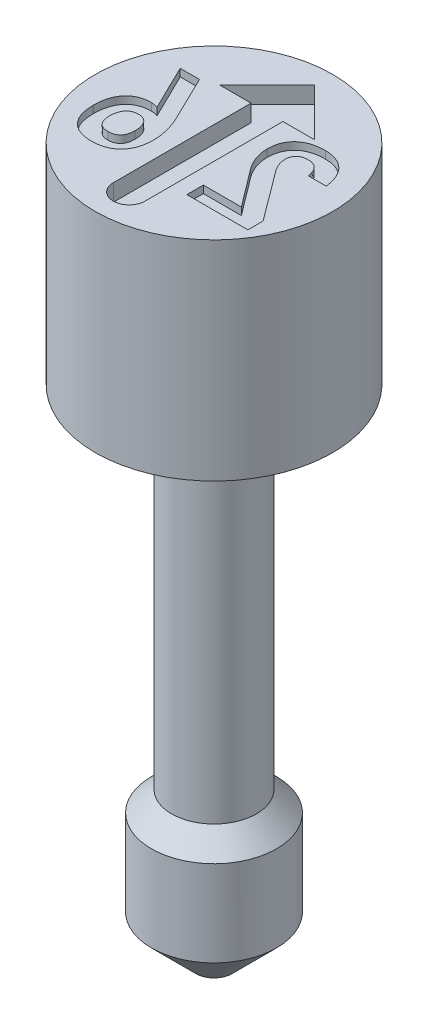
ISO-10303-21;
HEADER;
FILE_DESCRIPTION(('STEP AP214'),'2;1');
FILE_NAME('part.step','',(''),(''),'','','');
FILE_SCHEMA(('AUTOMOTIVE_DESIGN { 1 0 10303 214 1 1 1 1 }'));
ENDSEC;
DATA;
#1=APPLICATION_CONTEXT('core data for automotive mechanical design processes');
#2=APPLICATION_PROTOCOL_DEFINITION('international standard','automotive_design',2000,#1);
#3=PRODUCT_CONTEXT('',#1,'mechanical');
#4=PRODUCT('Part','Part','',(#3));
#5=PRODUCT_RELATED_PRODUCT_CATEGORY('part','',(#4));
#6=PRODUCT_DEFINITION_FORMATION('','',#4);
#7=PRODUCT_DEFINITION_CONTEXT('part definition',#1,'design');
#8=PRODUCT_DEFINITION('design','',#6,#7);
#9=PRODUCT_DEFINITION_SHAPE('','',#8);
#10=(LENGTH_UNIT() NAMED_UNIT(*) SI_UNIT(.MILLI.,.METRE.));
#11=(NAMED_UNIT(*) PLANE_ANGLE_UNIT() SI_UNIT($,.RADIAN.));
#12=(NAMED_UNIT(*) SI_UNIT($,.STERADIAN.) SOLID_ANGLE_UNIT());
#13=UNCERTAINTY_MEASURE_WITH_UNIT(LENGTH_MEASURE(1.E-05),#10,'distance_accuracy_value','');
#14=(GEOMETRIC_REPRESENTATION_CONTEXT(3) GLOBAL_UNCERTAINTY_ASSIGNED_CONTEXT((#13)) GLOBAL_UNIT_ASSIGNED_CONTEXT((#10,
#11,#12)) REPRESENTATION_CONTEXT('',''));
#15=CARTESIAN_POINT('',(0.,0.,0.));
#16=DIRECTION('',(0.,0.,1.));
#17=DIRECTION('',(1.,0.,0.));
#18=AXIS2_PLACEMENT_3D('',#15,#16,#17);
#19=CARTESIAN_POINT('',(0.,17.018,0.));
#20=DIRECTION('',(0.,1.,0.));
#21=DIRECTION('',(0.,0.,1.));
#22=AXIS2_PLACEMENT_3D('',#19,#20,#21);
#23=PLANE('',#22);
#24=DIRECTION('',(1.,0.,0.));
#25=VECTOR('',#24,1.);
#26=CARTESIAN_POINT('',(0.746640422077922,17.018,1.397));
#27=LINE('',#26,#25);
#28=CARTESIAN_POINT('',(0.746640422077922,17.018,1.397));
#29=VERTEX_POINT('',#28);
#30=CARTESIAN_POINT('',(2.20786201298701,17.018,1.397));
#31=VERTEX_POINT('',#30);
#32=EDGE_CURVE('E52',#29,#31,#27,.T.);
#33=ORIENTED_EDGE('',*,*,#32,.F.);
#34=DIRECTION('',(0.,0.,1.));
#35=VECTOR('',#34,1.);
#36=CARTESIAN_POINT('',(0.746640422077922,17.018,1.00115584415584));
#37=LINE('',#36,#35);
#38=CARTESIAN_POINT('',(0.746640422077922,17.018,1.00115584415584));
#39=VERTEX_POINT('',#38);
#40=EDGE_CURVE('E315',#39,#29,#37,.T.);
#41=ORIENTED_EDGE('',*,*,#40,.F.);
#42=DIRECTION('',(-1.,0.,0.));
#43=VECTOR('',#42,1.);
#44=CARTESIAN_POINT('',(1.65636038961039,17.018,1.00115584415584));
#45=LINE('',#44,#43);
#46=CARTESIAN_POINT('',(1.65636038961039,17.018,1.00115584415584));
#47=VERTEX_POINT('',#46);
#48=EDGE_CURVE('E318',#47,#39,#45,.T.);
#49=ORIENTED_EDGE('',*,*,#48,.F.);
#50=DIRECTION('',(0.601464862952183,0.,0.798899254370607));
#51=VECTOR('',#50,1.);
#52=CARTESIAN_POINT('',(0.979611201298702,17.018,0.10225974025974));
#53=LINE('',#52,#51);
#54=CARTESIAN_POINT('',(0.979611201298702,17.018,0.10225974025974));
#55=VERTEX_POINT('',#54);
#56=EDGE_CURVE('E1387',#55,#47,#53,.T.);
#57=ORIENTED_EDGE('',*,*,#56,.F.);
#58=CARTESIAN_POINT('',(0.760556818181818,17.018,-0.509030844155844));
#59=CARTESIAN_POINT('',(0.761232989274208,17.018,-0.483045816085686));
#60=CARTESIAN_POINT('',(0.762591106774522,17.018,-0.430853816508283));
#61=CARTESIAN_POINT('',(0.774336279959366,17.018,-0.352325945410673));
#62=CARTESIAN_POINT('',(0.791296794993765,17.018,-0.272982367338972));
#63=CARTESIAN_POINT('',(0.817077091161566,17.018,-0.193967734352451));
#64=CARTESIAN_POINT('',(0.848125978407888,17.018,-0.115731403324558));
#65=CARTESIAN_POINT('',(0.885982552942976,17.018,-0.0400564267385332));
#66=CARTESIAN_POINT('',(0.929184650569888,17.018,0.0332813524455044));
#67=CARTESIAN_POINT('',(0.962723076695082,17.018,0.0791585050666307));
#68=CARTESIAN_POINT('',(0.979611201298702,17.018,0.10225974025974));
#69=B_SPLINE_CURVE_WITH_KNOTS('',3,(#58,#59,#60,#61,#62,#63,#64,#65,#66,#67,#68),.UNSPECIFIED.,
.F.,.F.,(4,1,1,1,1,1,1,1,4),(0.,0.117962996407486,0.236933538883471,0.360005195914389,
0.486119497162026,0.613931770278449,0.74201296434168,0.870091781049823,1.),.UNSPECIFIED.);
#70=CARTESIAN_POINT('',(0.760556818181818,17.018,-0.509030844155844));
#71=VERTEX_POINT('',#70);
#72=EDGE_CURVE('E1382',#71,#55,#69,.T.);
#73=ORIENTED_EDGE('',*,*,#72,.F.);
#74=DIRECTION('',(0.,0.,1.));
#75=VECTOR('',#74,1.);
#76=CARTESIAN_POINT('',(0.760556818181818,17.018,-0.510577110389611));
#77=LINE('',#76,#75);
#78=CARTESIAN_POINT('',(0.760556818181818,17.018,-0.510577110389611));
#79=VERTEX_POINT('',#78);
#80=EDGE_CURVE('E1376',#79,#71,#77,.T.);
#81=ORIENTED_EDGE('',*,*,#80,.F.);
#82=CARTESIAN_POINT('',(1.4909099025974,17.018,-1.17598701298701));
#83=CARTESIAN_POINT('',(1.46253852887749,17.018,-1.17557382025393));
#84=CARTESIAN_POINT('',(1.4073859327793,17.018,-1.17477059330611));
#85=CARTESIAN_POINT('',(1.32729797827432,17.018,-1.16622385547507));
#86=CARTESIAN_POINT('',(1.25207347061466,17.018,-1.15309829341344));
#87=CARTESIAN_POINT('',(1.18177641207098,17.018,-1.13414225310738));
#88=CARTESIAN_POINT('',(1.11654612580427,17.018,-1.10935076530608));
#89=CARTESIAN_POINT('',(1.05632193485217,17.018,-1.07924708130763));
#90=CARTESIAN_POINT('',(1.00071095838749,17.018,-1.04427070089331));
#91=CARTESIAN_POINT('',(0.950537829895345,17.018,-1.00323568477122));
#92=CARTESIAN_POINT('',(0.90573102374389,17.018,-0.957456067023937));
#93=CARTESIAN_POINT('',(0.866530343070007,17.018,-0.907100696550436));
#94=CARTESIAN_POINT('',(0.834173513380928,17.018,-0.851734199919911));
#95=CARTESIAN_POINT('',(0.80634617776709,17.018,-0.792472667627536));
#96=CARTESIAN_POINT('',(0.786203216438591,17.018,-0.728029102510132));
#97=CARTESIAN_POINT('',(0.771041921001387,17.018,-0.659610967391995));
#98=CARTESIAN_POINT('',(0.762365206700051,17.018,-0.586565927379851));
#99=CARTESIAN_POINT('',(0.761170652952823,17.018,-0.536370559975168));
#100=CARTESIAN_POINT('',(0.760556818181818,17.018,-0.510577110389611));
#101=B_SPLINE_CURVE_WITH_KNOTS('',3,(#82,#83,#84,#85,#86,#87,#88,#89,#90,#91,#92,#93,#94,#95,
#96,#97,#98,#99,#100),.UNSPECIFIED.,.F.,.F.,(4,1,1,1,1,1,1,1,1,1,1,1,1,1,1,1,4),(0.,
0.0757177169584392,0.147191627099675,0.214761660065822,0.279410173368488,0.341256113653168,
0.400743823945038,0.458895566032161,0.516277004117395,0.573364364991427,0.629605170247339,
0.686164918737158,0.744246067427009,0.804009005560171,0.865999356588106,0.931142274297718,1.),.UNSPECIFIED.);
#102=CARTESIAN_POINT('',(1.4909099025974,17.018,-1.17598701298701));
#103=VERTEX_POINT('',#102);
#104=EDGE_CURVE('E1368',#103,#79,#101,.T.);
#105=ORIENTED_EDGE('',*,*,#104,.F.);
#106=CARTESIAN_POINT('',(2.23878733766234,17.018,-0.448726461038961));
#107=CARTESIAN_POINT('',(2.23549028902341,17.018,-0.476980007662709));
#108=CARTESIAN_POINT('',(2.22905505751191,17.018,-0.532125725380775));
#109=CARTESIAN_POINT('',(2.21155192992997,17.018,-0.611592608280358));
#110=CARTESIAN_POINT('',(2.19013592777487,17.018,-0.686323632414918));
#111=CARTESIAN_POINT('',(2.163305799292,17.018,-0.756220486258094));
#112=CARTESIAN_POINT('',(2.1312878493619,17.018,-0.821182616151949));
#113=CARTESIAN_POINT('',(2.09479714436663,17.018,-0.881690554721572));
#114=CARTESIAN_POINT('',(2.05201227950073,17.018,-0.936290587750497));
#115=CARTESIAN_POINT('',(2.00532691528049,17.018,-0.986613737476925));
#116=CARTESIAN_POINT('',(1.95354392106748,17.018,-1.03084309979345));
#117=CARTESIAN_POINT('',(1.89816784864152,17.018,-1.06972776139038));
#118=CARTESIAN_POINT('',(1.83921022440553,17.018,-1.10292552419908));
#119=CARTESIAN_POINT('',(1.77647967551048,17.018,-1.12985073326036));
#120=CARTESIAN_POINT('',(1.71007306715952,17.018,-1.15034668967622));
#121=CARTESIAN_POINT('',(1.64025434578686,17.018,-1.16538487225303));
#122=CARTESIAN_POINT('',(1.56672849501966,17.018,-1.17415578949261));
#123=CARTESIAN_POINT('',(1.51653253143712,17.018,-1.17536815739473));
#124=CARTESIAN_POINT('',(1.4909099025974,17.018,-1.17598701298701));
#125=B_SPLINE_CURVE_WITH_KNOTS('',3,(#106,#107,#108,#109,#110,#111,#112,#113,#114,#115,#116,
#117,#118,#119,#120,#121,#122,#123,#124),.UNSPECIFIED.,.F.,.F.,(4,1,1,1,1,1,1,1,1,1,1,1,1,1,1,1,
4),(0.,0.0735286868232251,0.143514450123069,0.210169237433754,0.274454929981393,
0.336856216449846,0.397291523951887,0.456843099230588,0.515945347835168,0.574554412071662,
0.632618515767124,0.690713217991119,0.749236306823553,0.808827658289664,0.870185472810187,
0.933735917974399,1.),.UNSPECIFIED.);
#126=CARTESIAN_POINT('',(2.23878733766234,17.018,-0.448726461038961));
#127=VERTEX_POINT('',#126);
#128=EDGE_CURVE('E1363',#127,#103,#125,.T.);
#129=ORIENTED_EDGE('',*,*,#128,.F.);
#130=DIRECTION('',(0.,0.,-1.));
#131=VECTOR('',#130,1.);
#132=CARTESIAN_POINT('',(2.23878733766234,17.018,-0.447180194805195));
#133=LINE('',#132,#131);
#134=CARTESIAN_POINT('',(2.23878733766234,17.018,-0.447180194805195));
#135=VERTEX_POINT('',#134);
#136=EDGE_CURVE('E1360',#135,#127,#133,.T.);
#137=ORIENTED_EDGE('',*,*,#136,.F.);
#138=DIRECTION('',(1.,0.,0.));
#139=VECTOR('',#138,1.);
#140=CARTESIAN_POINT('',(1.81098701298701,17.018,-0.447180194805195));
#141=LINE('',#140,#139);
#142=CARTESIAN_POINT('',(1.81098701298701,17.018,-0.447180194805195));
#143=VERTEX_POINT('',#142);
#144=EDGE_CURVE('E1357',#143,#135,#141,.T.);
#145=ORIENTED_EDGE('',*,*,#144,.F.);
#146=DIRECTION('',(0.,0.,1.));
#147=VECTOR('',#146,1.);
#148=CARTESIAN_POINT('',(1.81098701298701,17.018,-0.448726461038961));
#149=LINE('',#148,#147);
#150=CARTESIAN_POINT('',(1.81098701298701,17.018,-0.448726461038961));
#151=VERTEX_POINT('',#150);
#152=EDGE_CURVE('E1351',#151,#143,#149,.T.);
#153=ORIENTED_EDGE('',*,*,#152,.F.);
#154=CARTESIAN_POINT('',(1.48730194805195,17.018,-0.780142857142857));
#155=CARTESIAN_POINT('',(1.5087368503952,17.018,-0.779343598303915));
#156=CARTESIAN_POINT('',(1.5502418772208,17.018,-0.777795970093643));
#157=CARTESIAN_POINT('',(1.60915560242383,17.018,-0.760309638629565));
#158=CARTESIAN_POINT('',(1.66256678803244,17.018,-0.733442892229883));
#159=CARTESIAN_POINT('',(1.70858991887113,17.018,-0.694620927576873));
#160=CARTESIAN_POINT('',(1.74727125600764,17.018,-0.646229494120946));
#161=CARTESIAN_POINT('',(1.77793475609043,17.018,-0.588646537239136));
#162=CARTESIAN_POINT('',(1.79940260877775,17.018,-0.52170759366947));
#163=CARTESIAN_POINT('',(1.80701071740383,17.018,-0.473776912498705));
#164=CARTESIAN_POINT('',(1.81098701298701,17.018,-0.448726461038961));
#165=B_SPLINE_CURVE_WITH_KNOTS('',3,(#154,#155,#156,#157,#158,#159,#160,#161,#162,#163,#164),
.UNSPECIFIED.,.F.,.F.,(4,1,1,1,1,1,1,1,4),(0.,0.124986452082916,0.242014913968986,
0.356148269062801,0.472436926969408,0.591058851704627,0.716468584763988,0.851815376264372,1.),.UNSPECIFIED.);
#166=CARTESIAN_POINT('',(1.48730194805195,17.018,-0.780142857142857));
#167=VERTEX_POINT('',#166);
#168=EDGE_CURVE('E1343',#167,#151,#165,.T.);
#169=ORIENTED_EDGE('',*,*,#168,.F.);
#170=CARTESIAN_POINT('',(1.18990340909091,17.018,-0.510577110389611));
#171=CARTESIAN_POINT('',(1.19059833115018,17.018,-0.530960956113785));
#172=CARTESIAN_POINT('',(1.19192725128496,17.018,-0.569941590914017));
#173=CARTESIAN_POINT('',(1.20734116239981,17.018,-0.624505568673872));
#174=CARTESIAN_POINT('',(1.23184197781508,17.018,-0.671982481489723));
#175=CARTESIAN_POINT('',(1.26677839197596,17.018,-0.71126672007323));
#176=CARTESIAN_POINT('',(1.31024547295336,17.018,-0.7425286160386));
#177=CARTESIAN_POINT('',(1.36217758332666,17.018,-0.765083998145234));
#178=CARTESIAN_POINT('',(1.42229567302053,17.018,-0.777513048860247));
#179=CARTESIAN_POINT('',(1.4649100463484,17.018,-0.779236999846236));
#180=CARTESIAN_POINT('',(1.48730194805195,17.018,-0.780142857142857));
#181=B_SPLINE_CURVE_WITH_KNOTS('',3,(#170,#171,#172,#173,#174,#175,#176,#177,#178,#179,#180),
.UNSPECIFIED.,.F.,.F.,(4,1,1,1,1,1,1,1,4),(0.,0.133827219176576,0.255921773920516,
0.369738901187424,0.482715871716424,0.598532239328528,0.719553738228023,0.85263833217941,1.),.UNSPECIFIED.);
#182=CARTESIAN_POINT('',(1.18990340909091,17.018,-0.510577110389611));
#183=VERTEX_POINT('',#182);
#184=EDGE_CURVE('E1338',#183,#167,#181,.T.);
#185=ORIENTED_EDGE('',*,*,#184,.F.);
#186=DIRECTION('',(0.,0.,-1.));
#187=VECTOR('',#186,1.);
#188=CARTESIAN_POINT('',(1.18990340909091,17.018,-0.506969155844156));
#189=LINE('',#188,#187);
#190=CARTESIAN_POINT('',(1.18990340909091,17.018,-0.506969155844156));
#191=VERTEX_POINT('',#190);
#192=EDGE_CURVE('E1332',#191,#183,#189,.T.);
#193=ORIENTED_EDGE('',*,*,#192,.F.);
#194=CARTESIAN_POINT('',(1.33267532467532,17.018,-0.142565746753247));
#195=CARTESIAN_POINT('',(1.32184500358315,17.018,-0.157561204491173));
#196=CARTESIAN_POINT('',(1.30048864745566,17.018,-0.187130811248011));
#197=CARTESIAN_POINT('',(1.271910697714,17.018,-0.233105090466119));
#198=CARTESIAN_POINT('',(1.24783679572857,17.018,-0.280151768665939));
#199=CARTESIAN_POINT('',(1.22707710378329,17.018,-0.32740175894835));
#200=CARTESIAN_POINT('',(1.21081740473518,17.018,-0.374306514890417));
#201=CARTESIAN_POINT('',(1.19853273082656,17.018,-0.419873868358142));
#202=CARTESIAN_POINT('',(1.19175624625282,17.018,-0.463986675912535));
#203=CARTESIAN_POINT('',(1.19051155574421,17.018,-0.49286125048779));
#204=CARTESIAN_POINT('',(1.18990340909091,17.018,-0.506969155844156));
#205=B_SPLINE_CURVE_WITH_KNOTS('',3,(#194,#195,#196,#197,#198,#199,#200,#201,#202,#203,#204),
.UNSPECIFIED.,.F.,.F.,(4,1,1,1,1,1,1,1,4),(0.,0.139527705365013,0.275135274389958,
0.407888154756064,0.537917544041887,0.66417107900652,0.782063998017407,0.893518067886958,1.),.UNSPECIFIED.);
#206=CARTESIAN_POINT('',(1.33267532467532,17.018,-0.142565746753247));
#207=VERTEX_POINT('',#206);
#208=EDGE_CURVE('E1327',#207,#191,#205,.T.);
#209=ORIENTED_EDGE('',*,*,#208,.F.);
#210=DIRECTION('',(-0.597969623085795,0.,-0.801518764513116));
#211=VECTOR('',#210,1.);
#212=CARTESIAN_POINT('',(2.20786201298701,17.018,1.0305349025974));
#213=LINE('',#212,#211);
#214=CARTESIAN_POINT('',(2.20786201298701,17.018,1.0305349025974));
#215=VERTEX_POINT('',#214);
#216=EDGE_CURVE('E1324',#215,#207,#213,.T.);
#217=ORIENTED_EDGE('',*,*,#216,.F.);
#218=DIRECTION('',(0.,0.,-1.));
#219=VECTOR('',#218,1.);
#220=CARTESIAN_POINT('',(2.20786201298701,17.018,1.397));
#221=LINE('',#220,#219);
#222=EDGE_CURVE('E1322',#31,#215,#221,.T.);
#223=ORIENTED_EDGE('',*,*,#222,.F.);
#224=EDGE_LOOP('',(#33,#41,#49,#57,#73,#81,#105,#129,#137,#145,#153,#169,#185,#193,#209,#217,#223));
#225=FACE_BOUND('',#224,.T.);
#226=CARTESIAN_POINT('',(-2.2290974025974,17.018,0.663554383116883));
#227=CARTESIAN_POINT('',(-2.22850301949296,17.018,0.693128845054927));
#228=CARTESIAN_POINT('',(-2.2273460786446,17.018,0.750694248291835));
#229=CARTESIAN_POINT('',(-2.21840570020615,17.018,0.834426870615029));
#230=CARTESIAN_POINT('',(-2.20429082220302,17.018,0.913139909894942));
#231=CARTESIAN_POINT('',(-2.18370350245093,17.018,0.98671946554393));
#232=CARTESIAN_POINT('',(-2.15683866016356,17.018,1.05507419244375));
#233=CARTESIAN_POINT('',(-2.1240979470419,17.018,1.11838535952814));
#234=CARTESIAN_POINT('',(-2.08615653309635,17.018,1.17706318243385));
#235=CARTESIAN_POINT('',(-2.04147647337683,17.018,1.22968521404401));
#236=CARTESIAN_POINT('',(-1.99171789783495,17.018,1.27687815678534));
#237=CARTESIAN_POINT('',(-1.93698901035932,17.018,1.31845123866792));
#238=CARTESIAN_POINT('',(-1.87692584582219,17.018,1.35290950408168));
#239=CARTESIAN_POINT('',(-1.81202377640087,17.018,1.3810024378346));
#240=CARTESIAN_POINT('',(-1.74242096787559,17.018,1.40302715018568));
#241=CARTESIAN_POINT('',(-1.66772832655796,17.018,1.41906907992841));
#242=CARTESIAN_POINT('',(-1.58814512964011,17.018,1.42828190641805));
#243=CARTESIAN_POINT('',(-1.53347336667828,17.018,1.42940912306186));
#244=CARTESIAN_POINT('',(-1.50544480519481,17.018,1.42998701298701));
#245=B_SPLINE_CURVE_WITH_KNOTS('',3,(#226,#227,#228,#229,#230,#231,#232,#233,#234,#235,#236,
#237,#238,#239,#240,#241,#242,#243,#244),.UNSPECIFIED.,.F.,.F.,(4,1,1,1,1,1,1,1,1,1,1,1,1,1,1,1,
4),(0.,0.073986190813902,0.144010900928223,0.210453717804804,0.273873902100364,
0.334863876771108,0.393890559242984,0.451957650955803,0.50931223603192,0.5661765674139,
0.62326632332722,0.680854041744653,0.738995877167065,0.7999039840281,0.863226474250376,
0.929880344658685,1.),.UNSPECIFIED.);
#246=CARTESIAN_POINT('',(-2.2290974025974,17.018,0.663554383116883));
#247=VERTEX_POINT('',#246);
#248=CARTESIAN_POINT('',(-1.50544480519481,17.018,1.42998701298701));
#249=VERTEX_POINT('',#248);
#250=EDGE_CURVE('E60',#247,#249,#245,.T.);
#251=ORIENTED_EDGE('',*,*,#250,.F.);
#252=DIRECTION('',(0.,0.,1.));
#253=VECTOR('',#252,1.);
#254=CARTESIAN_POINT('',(-2.2290974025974,17.018,0.662008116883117));
#255=LINE('',#254,#253);
#256=CARTESIAN_POINT('',(-2.2290974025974,17.018,0.662008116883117));
#257=VERTEX_POINT('',#256);
#258=EDGE_CURVE('E436',#257,#247,#255,.T.);
#259=ORIENTED_EDGE('',*,*,#258,.F.);
#260=CARTESIAN_POINT('',(-1.58739691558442,17.018,-0.0874155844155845));
#261=CARTESIAN_POINT('',(-1.61200018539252,17.018,-0.0868639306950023));
#262=CARTESIAN_POINT('',(-1.66018567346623,17.018,-0.0857835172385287));
#263=CARTESIAN_POINT('',(-1.73017749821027,17.018,-0.0761243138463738));
#264=CARTESIAN_POINT('',(-1.79624627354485,17.018,-0.0617728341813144));
#265=CARTESIAN_POINT('',(-1.85746639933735,17.018,-0.0394401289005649));
#266=CARTESIAN_POINT('',(-1.91520814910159,17.018,-0.0126107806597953));
#267=CARTESIAN_POINT('',(-1.9679030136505,17.018,0.0220373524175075));
#268=CARTESIAN_POINT('',(-2.01686023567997,17.018,0.0618857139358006));
#269=CARTESIAN_POINT('',(-2.06121959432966,17.018,0.10799231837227));
#270=CARTESIAN_POINT('',(-2.10095819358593,17.018,0.159678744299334));
#271=CARTESIAN_POINT('',(-2.13556889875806,17.018,0.216516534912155));
#272=CARTESIAN_POINT('',(-2.16449869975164,17.018,0.278468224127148));
#273=CARTESIAN_POINT('',(-2.18829770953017,17.018,0.345431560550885));
#274=CARTESIAN_POINT('',(-2.20656274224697,17.018,0.417597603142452));
#275=CARTESIAN_POINT('',(-2.22000596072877,17.018,0.494590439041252));
#276=CARTESIAN_POINT('',(-2.22770736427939,17.018,0.576633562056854));
#277=CARTESIAN_POINT('',(-2.2286243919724,17.018,0.632956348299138));
#278=CARTESIAN_POINT('',(-2.2290974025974,17.018,0.662008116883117));
#279=B_SPLINE_CURVE_WITH_KNOTS('',3,(#260,#261,#262,#263,#264,#265,#266,#267,#268,#269,#270,
#271,#272,#273,#274,#275,#276,#277,#278),.UNSPECIFIED.,.F.,.F.,(4,1,1,1,1,1,1,1,1,1,1,1,1,1,1,1,
4),(0.,0.0658754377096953,0.129017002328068,0.188974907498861,0.246623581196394,
0.303237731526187,0.359155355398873,0.415082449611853,0.472045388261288,0.530135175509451,
0.589416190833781,0.649949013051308,0.712984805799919,0.779517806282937,0.849133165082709,
0.922181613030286,1.),.UNSPECIFIED.);
#280=CARTESIAN_POINT('',(-1.58739691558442,17.018,-0.0874155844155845));
#281=VERTEX_POINT('',#280);
#282=EDGE_CURVE('E615',#281,#257,#279,.T.);
#283=ORIENTED_EDGE('',*,*,#282,.F.);
#284=CARTESIAN_POINT('',(-1.26525811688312,17.018,0.0831891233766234));
#285=CARTESIAN_POINT('',(-1.27306763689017,17.018,0.0694879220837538));
#286=CARTESIAN_POINT('',(-1.28837798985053,17.018,0.0426270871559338));
#287=CARTESIAN_POINT('',(-1.31852897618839,17.018,0.00796156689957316));
#288=CARTESIAN_POINT('',(-1.35216573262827,17.018,-0.0220638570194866));
#289=CARTESIAN_POINT('',(-1.391040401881,17.018,-0.0458781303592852));
#290=CARTESIAN_POINT('',(-1.43412839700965,17.018,-0.0644350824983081));
#291=CARTESIAN_POINT('',(-1.48144606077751,17.018,-0.0776917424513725));
#292=CARTESIAN_POINT('',(-1.53296920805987,17.018,-0.0862421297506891));
#293=CARTESIAN_POINT('',(-1.56880547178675,17.018,-0.0870147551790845));
#294=CARTESIAN_POINT('',(-1.58739691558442,17.018,-0.0874155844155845));
#295=B_SPLINE_CURVE_WITH_KNOTS('',3,(#284,#285,#286,#287,#288,#289,#290,#291,#292,#293,#294),
.UNSPECIFIED.,.F.,.F.,(4,1,1,1,1,1,1,1,4),(0.,0.122662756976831,0.240477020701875,
0.356264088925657,0.472961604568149,0.594130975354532,0.720885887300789,0.855198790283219,1.),.UNSPECIFIED.);
#296=CARTESIAN_POINT('',(-1.42430185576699,17.018,-0.0596611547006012));
#297=VERTEX_POINT('',#296);
#298=EDGE_CURVE('E620',#297,#281,#295,.T.);
#299=ORIENTED_EDGE('',*,*,#298,.F.);
#300=DIRECTION('',(0.438125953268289,0.,0.898913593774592));
#301=VECTOR('',#300,1.);
#302=CARTESIAN_POINT('',(-1.95231574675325,17.018,-1.143));
#303=LINE('',#302,#301);
#304=CARTESIAN_POINT('',(-1.95231574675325,17.018,-1.143));
#305=VERTEX_POINT('',#304);
#306=EDGE_CURVE('E628',#305,#297,#303,.T.);
#307=ORIENTED_EDGE('',*,*,#306,.F.);
#308=DIRECTION('',(-1.,0.,0.));
#309=VECTOR('',#308,1.);
#310=CARTESIAN_POINT('',(-1.49152840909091,17.018,-1.143));
#311=LINE('',#310,#309);
#312=CARTESIAN_POINT('',(-1.49152840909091,17.018,-1.143));
#313=VERTEX_POINT('',#312);
#314=EDGE_CURVE('E634',#313,#305,#311,.T.);
#315=ORIENTED_EDGE('',*,*,#314,.F.);
#316=DIRECTION('',(-0.436864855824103,0.,-0.899527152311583));
#317=VECTOR('',#316,1.);
#318=CARTESIAN_POINT('',(-0.959097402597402,17.018,-0.0466972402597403));
#319=LINE('',#318,#317);
#320=CARTESIAN_POINT('',(-0.959097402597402,17.018,-0.0466972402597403));
#321=VERTEX_POINT('',#320);
#322=EDGE_CURVE('E637',#321,#313,#319,.T.);
#323=ORIENTED_EDGE('',*,*,#322,.F.);
#324=CARTESIAN_POINT('',(-0.783338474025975,17.018,0.659431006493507));
#325=CARTESIAN_POINT('',(-0.784047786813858,17.018,0.631582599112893));
#326=CARTESIAN_POINT('',(-0.785491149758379,17.018,0.574914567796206));
#327=CARTESIAN_POINT('',(-0.793784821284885,17.018,0.48877580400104));
#328=CARTESIAN_POINT('',(-0.808592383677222,17.018,0.400397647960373));
#329=CARTESIAN_POINT('',(-0.828389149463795,17.018,0.310146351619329));
#330=CARTESIAN_POINT('',(-0.85447507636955,17.018,0.219541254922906));
#331=CARTESIAN_POINT('',(-0.883962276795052,17.018,0.129143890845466));
#332=CARTESIAN_POINT('',(-0.91928143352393,17.018,0.0404027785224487));
#333=CARTESIAN_POINT('',(-0.945795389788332,17.018,-0.0175982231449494));
#334=CARTESIAN_POINT('',(-0.959097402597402,17.018,-0.0466972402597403));
#335=B_SPLINE_CURVE_WITH_KNOTS('',3,(#324,#325,#326,#327,#328,#329,#330,#331,#332,#333,#334),
.UNSPECIFIED.,.F.,.F.,(4,1,1,1,1,1,1,1,4),(0.,0.1139317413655,0.231836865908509,
0.353616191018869,0.480309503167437,0.609573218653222,0.73914226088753,0.869128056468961,1.),.UNSPECIFIED.);
#336=CARTESIAN_POINT('',(-0.783338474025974,17.018,0.659431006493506));
#337=VERTEX_POINT('',#336);
#338=EDGE_CURVE('E640',#337,#321,#335,.T.);
#339=ORIENTED_EDGE('',*,*,#338,.F.);
#340=DIRECTION('',(0.,0.,-1.));
#341=VECTOR('',#340,1.);
#342=CARTESIAN_POINT('',(-0.783338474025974,17.018,0.660977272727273));
#343=LINE('',#342,#341);
#344=CARTESIAN_POINT('',(-0.783338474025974,17.018,0.660977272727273));
#345=VERTEX_POINT('',#344);
#346=EDGE_CURVE('E645',#345,#337,#343,.T.);
#347=ORIENTED_EDGE('',*,*,#346,.F.);
#348=CARTESIAN_POINT('',(-1.50544480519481,17.018,1.42998701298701));
#349=CARTESIAN_POINT('',(-1.47758710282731,17.018,1.42941785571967));
#350=CARTESIAN_POINT('',(-1.42342670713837,17.018,1.42831131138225));
#351=CARTESIAN_POINT('',(-1.34453553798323,17.018,1.41902521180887));
#352=CARTESIAN_POINT('',(-1.27053108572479,17.018,1.40301147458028));
#353=CARTESIAN_POINT('',(-1.20118861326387,17.018,1.38100485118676));
#354=CARTESIAN_POINT('',(-1.13673084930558,17.018,1.35245989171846));
#355=CARTESIAN_POINT('',(-1.07706820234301,17.018,1.31775053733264));
#356=CARTESIAN_POINT('',(-1.02193510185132,17.018,1.27676314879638));
#357=CARTESIAN_POINT('',(-0.971939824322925,17.018,1.22933179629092));
#358=CARTESIAN_POINT('',(-0.927730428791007,17.018,1.17596111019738));
#359=CARTESIAN_POINT('',(-0.88844073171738,17.018,1.11789704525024));
#360=CARTESIAN_POINT('',(-0.856201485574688,17.018,1.05397368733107));
#361=CARTESIAN_POINT('',(-0.829282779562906,17.018,0.985331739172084));
#362=CARTESIAN_POINT('',(-0.80874302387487,17.018,0.911373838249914));
#363=CARTESIAN_POINT('',(-0.793902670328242,17.018,0.832592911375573));
#364=CARTESIAN_POINT('',(-0.785111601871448,17.018,0.748453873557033));
#365=CARTESIAN_POINT('',(-0.783941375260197,17.018,0.690721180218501));
#366=CARTESIAN_POINT('',(-0.783338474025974,17.018,0.660977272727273));
#367=B_SPLINE_CURVE_WITH_KNOTS('',3,(#348,#349,#350,#351,#352,#353,#354,#355,#356,#357,#358,
#359,#360,#361,#362,#363,#364,#365,#366),.UNSPECIFIED.,.F.,.F.,(4,1,1,1,1,1,1,1,1,1,1,1,1,1,1,1,
4),(0.,0.0696928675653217,0.13549549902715,0.198400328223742,0.258901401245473,
0.317218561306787,0.374436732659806,0.431270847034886,0.488745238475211,0.546431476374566,
0.604379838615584,0.663791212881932,0.725183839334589,0.788606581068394,0.855553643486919,
0.925581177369,1.),.UNSPECIFIED.);
#368=EDGE_CURVE('E651',#249,#345,#367,.T.);
#369=ORIENTED_EDGE('',*,*,#368,.F.);
#370=EDGE_LOOP('',(#251,#259,#283,#299,#307,#315,#323,#339,#347,#369));
#371=FACE_BOUND('',#370,.T.);
#372=CARTESIAN_POINT('',(0.,17.018,2.032));
#373=DIRECTION('',(0.,1.,0.));
#374=DIRECTION('',(0.,0.,1.));
#375=AXIS2_PLACEMENT_3D('',#372,#373,#374);
#376=CIRCLE('',#375,0.381);
#377=CARTESIAN_POINT('',(-0.381,17.018,2.032));
#378=VERTEX_POINT('',#377);
#379=CARTESIAN_POINT('',(0.381,17.018,2.032));
#380=VERTEX_POINT('',#379);
#381=EDGE_CURVE('E570',#378,#380,#376,.T.);
#382=ORIENTED_EDGE('',*,*,#381,.F.);
#383=DIRECTION('',(0.,0.,1.));
#384=VECTOR('',#383,1.);
#385=CARTESIAN_POINT('',(-0.381,17.018,2.032));
#386=LINE('',#385,#384);
#387=CARTESIAN_POINT('',(-0.381,17.018,-1.27));
#388=VERTEX_POINT('',#387);
#389=EDGE_CURVE('E551',#388,#378,#386,.T.);
#390=ORIENTED_EDGE('',*,*,#389,.F.);
#391=DIRECTION('',(1.,0.,0.));
#392=VECTOR('',#391,1.);
#393=CARTESIAN_POINT('',(-0.381,17.018,-1.27));
#394=LINE('',#393,#392);
#395=CARTESIAN_POINT('',(-1.143,17.018,-1.27));
#396=VERTEX_POINT('',#395);
#397=EDGE_CURVE('E555',#396,#388,#394,.T.);
#398=ORIENTED_EDGE('',*,*,#397,.F.);
#399=DIRECTION('',(-0.707106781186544,0.,0.707106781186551));
#400=VECTOR('',#399,1.);
#401=CARTESIAN_POINT('',(0.,17.018,-2.41300000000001));
#402=LINE('',#401,#400);
#403=CARTESIAN_POINT('',(0.,17.018,-2.41300000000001));
#404=VERTEX_POINT('',#403);
#405=EDGE_CURVE('E558',#404,#396,#402,.T.);
#406=ORIENTED_EDGE('',*,*,#405,.F.);
#407=DIRECTION('',(-0.707106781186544,0.,-0.707106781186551));
#408=VECTOR('',#407,1.);
#409=CARTESIAN_POINT('',(1.143,17.018,-1.27));
#410=LINE('',#409,#408);
#411=CARTESIAN_POINT('',(1.143,17.018,-1.27));
#412=VERTEX_POINT('',#411);
#413=EDGE_CURVE('E561',#412,#404,#410,.T.);
#414=ORIENTED_EDGE('',*,*,#413,.F.);
#415=DIRECTION('',(1.,0.,0.));
#416=VECTOR('',#415,1.);
#417=CARTESIAN_POINT('',(0.381,17.018,-1.27));
#418=LINE('',#417,#416);
#419=CARTESIAN_POINT('',(0.381,17.018,-1.27));
#420=VERTEX_POINT('',#419);
#421=EDGE_CURVE('E564',#420,#412,#418,.T.);
#422=ORIENTED_EDGE('',*,*,#421,.F.);
#423=DIRECTION('',(0.,0.,-1.));
#424=VECTOR('',#423,1.);
#425=CARTESIAN_POINT('',(0.381,17.018,2.032));
#426=LINE('',#425,#424);
#427=EDGE_CURVE('E567',#380,#420,#426,.T.);
#428=ORIENTED_EDGE('',*,*,#427,.F.);
#429=EDGE_LOOP('',(#382,#390,#398,#406,#414,#422,#428));
#430=FACE_BOUND('',#429,.T.);
#431=CARTESIAN_POINT('',(0.,17.018,0.));
#432=DIRECTION('',(0.,-1.,0.));
#433=DIRECTION('',(0.,0.,-1.));
#434=AXIS2_PLACEMENT_3D('',#431,#432,#433);
#435=CIRCLE('',#434,2.8448);
#436=CARTESIAN_POINT('',(0.,17.018,-2.8448));
#437=VERTEX_POINT('',#436);
#438=EDGE_CURVE('E11',#437,#437,#435,.T.);
#439=ORIENTED_EDGE('',*,*,#438,.F.);
#440=EDGE_LOOP('',(#439));
#441=FACE_BOUND('',#440,.T.);
#442=ADVANCED_FACE('F37',(#225,#371,#430,#441),#23,.T.);
#443=CARTESIAN_POINT('',(0.,0.,0.));
#444=DIRECTION('',(0.,-1.,0.));
#445=DIRECTION('',(0.,0.,-1.));
#446=AXIS2_PLACEMENT_3D('',#443,#444,#445);
#447=CYLINDRICAL_SURFACE('',#446,2.8448);
#448=ORIENTED_EDGE('',*,*,#438,.T.);
#449=EDGE_LOOP('',(#448));
#450=FACE_BOUND('',#449,.T.);
#451=CARTESIAN_POINT('',(0.,12.0142,0.));
#452=DIRECTION('',(0.,-1.,0.));
#453=DIRECTION('',(0.,0.,-1.));
#454=AXIS2_PLACEMENT_3D('',#451,#452,#453);
#455=CIRCLE('',#454,2.8448);
#456=CARTESIAN_POINT('',(0.,12.0142,-2.8448));
#457=VERTEX_POINT('',#456);
#458=EDGE_CURVE('E45',#457,#457,#455,.T.);
#459=ORIENTED_EDGE('',*,*,#458,.F.);
#460=EDGE_LOOP('',(#459));
#461=FACE_BOUND('',#460,.T.);
#462=ADVANCED_FACE('F507',(#450,#461),#447,.T.);
#463=CARTESIAN_POINT('',(2.8448,12.0142,0.));
#464=DIRECTION('',(0.,-1.,0.));
#465=DIRECTION('',(0.,0.,-1.));
#466=AXIS2_PLACEMENT_3D('',#463,#464,#465);
#467=PLANE('',#466);
#468=ORIENTED_EDGE('',*,*,#458,.T.);
#469=EDGE_LOOP('',(#468));
#470=FACE_BOUND('',#469,.T.);
#471=CARTESIAN_POINT('',(0.,12.0142,0.));
#472=DIRECTION('',(0.,-1.,0.));
#473=DIRECTION('',(0.,0.,-1.));
#474=AXIS2_PLACEMENT_3D('',#471,#472,#473);
#475=CIRCLE('',#474,1.016);
#476=CARTESIAN_POINT('',(0.,12.0142,-1.016));
#477=VERTEX_POINT('',#476);
#478=EDGE_CURVE('E519',#477,#477,#475,.T.);
#479=ORIENTED_EDGE('',*,*,#478,.F.);
#480=EDGE_LOOP('',(#479));
#481=FACE_BOUND('',#480,.T.);
#482=ADVANCED_FACE('F504',(#470,#481),#467,.T.);
#483=CARTESIAN_POINT('',(0.,0.,0.));
#484=DIRECTION('',(0.,-1.,0.));
#485=DIRECTION('',(0.,0.,-1.));
#486=AXIS2_PLACEMENT_3D('',#483,#484,#485);
#487=CYLINDRICAL_SURFACE('',#486,1.016);
#488=ORIENTED_EDGE('',*,*,#478,.T.);
#489=EDGE_LOOP('',(#488));
#490=FACE_BOUND('',#489,.T.);
#491=CARTESIAN_POINT('',(0.,3.6068,0.));
#492=DIRECTION('',(0.,-1.,0.));
#493=DIRECTION('',(0.,0.,-1.));
#494=AXIS2_PLACEMENT_3D('',#491,#492,#493);
#495=CIRCLE('',#494,1.016);
#496=CARTESIAN_POINT('',(0.,3.6068,-1.016));
#497=VERTEX_POINT('',#496);
#498=EDGE_CURVE('E521',#497,#497,#495,.T.);
#499=ORIENTED_EDGE('',*,*,#498,.F.);
#500=EDGE_LOOP('',(#499));
#501=FACE_BOUND('',#500,.T.);
#502=ADVANCED_FACE('F500',(#490,#501),#487,.T.);
#503=CARTESIAN_POINT('',(0.,3.12420000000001,0.));
#504=DIRECTION('',(0.,-1.,0.));
#505=DIRECTION('',(0.,0.,-1.));
#506=AXIS2_PLACEMENT_3D('',#503,#504,#505);
#507=CONICAL_SURFACE('',#506,1.4986,0.785398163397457);
#508=ORIENTED_EDGE('',*,*,#498,.T.);
#509=EDGE_LOOP('',(#508));
#510=FACE_BOUND('',#509,.T.);
#511=CARTESIAN_POINT('',(0.,3.12420000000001,0.));
#512=DIRECTION('',(0.,-1.,0.));
#513=DIRECTION('',(0.,0.,-1.));
#514=AXIS2_PLACEMENT_3D('',#511,#512,#513);
#515=CIRCLE('',#514,1.4986);
#516=CARTESIAN_POINT('',(0.,3.12420000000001,-1.4986));
#517=VERTEX_POINT('',#516);
#518=EDGE_CURVE('E526',#517,#517,#515,.T.);
#519=ORIENTED_EDGE('',*,*,#518,.F.);
#520=EDGE_LOOP('',(#519));
#521=FACE_BOUND('',#520,.T.);
#522=ADVANCED_FACE('F496',(#510,#521),#507,.T.);
#523=CARTESIAN_POINT('',(0.,0.,0.));
#524=DIRECTION('',(0.,-1.,0.));
#525=DIRECTION('',(0.,0.,-1.));
#526=AXIS2_PLACEMENT_3D('',#523,#524,#525);
#527=CYLINDRICAL_SURFACE('',#526,1.4986);
#528=ORIENTED_EDGE('',*,*,#518,.T.);
#529=EDGE_LOOP('',(#528));
#530=FACE_BOUND('',#529,.T.);
#531=CARTESIAN_POINT('',(0.,1.0668,0.));
#532=DIRECTION('',(0.,-1.,0.));
#533=DIRECTION('',(0.,0.,-1.));
#534=AXIS2_PLACEMENT_3D('',#531,#532,#533);
#535=CIRCLE('',#534,1.4986);
#536=CARTESIAN_POINT('',(0.,1.0668,1.4986));
#537=VERTEX_POINT('',#536);
#538=EDGE_CURVE('E529',#537,#537,#535,.T.);
#539=ORIENTED_EDGE('',*,*,#538,.F.);
#540=EDGE_LOOP('',(#539));
#541=FACE_BOUND('',#540,.T.);
#542=ADVANCED_FACE('F492',(#530,#541),#527,.T.);
#543=CARTESIAN_POINT('',(0.,0.,0.));
#544=DIRECTION('',(0.,1.,0.));
#545=DIRECTION('',(0.,0.,1.));
#546=AXIS2_PLACEMENT_3D('',#543,#544,#545);
#547=CONICAL_SURFACE('',#546,0.431800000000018,0.78539816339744);
#548=CARTESIAN_POINT('',(0.,0.,0.));
#549=DIRECTION('',(0.,-1.,0.));
#550=DIRECTION('',(0.,0.,-1.));
#551=AXIS2_PLACEMENT_3D('',#548,#549,#550);
#552=CIRCLE('',#551,0.431800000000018);
#553=CARTESIAN_POINT('',(0.,0.,0.431800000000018));
#554=VERTEX_POINT('',#553);
#555=EDGE_CURVE('E532',#554,#554,#552,.T.);
#556=CARTESIAN_POINT('',(0.,1.0668,1.4986));
#557=CARTESIAN_POINT('',(0.,1.0556875,1.4874875));
#558=CARTESIAN_POINT('',(0.,1.044575,1.476375));
#559=CARTESIAN_POINT('',(0.,1.02235,1.45415));
#560=CARTESIAN_POINT('',(0.,1.0112375,1.4430375));
#561=CARTESIAN_POINT('',(0.,0.9890125,1.4208125));
#562=CARTESIAN_POINT('',(0.,0.977900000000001,1.4097));
#563=CARTESIAN_POINT('',(0.,0.955675,1.387475));
#564=CARTESIAN_POINT('',(0.,0.944562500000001,1.3763625));
#565=CARTESIAN_POINT('',(0.,0.9223375,1.3541375));
#566=CARTESIAN_POINT('',(0.,0.911225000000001,1.343025));
#567=CARTESIAN_POINT('',(0.,0.889,1.3208));
#568=CARTESIAN_POINT('',(0.,0.8778875,1.3096875));
#569=CARTESIAN_POINT('',(0.,0.8556625,1.2874625));
#570=CARTESIAN_POINT('',(0.,0.84455,1.27635));
#571=CARTESIAN_POINT('',(0.,0.822325,1.254125));
#572=CARTESIAN_POINT('',(0.,0.8112125,1.2430125));
#573=CARTESIAN_POINT('',(0.,0.7889875,1.2207875));
#574=CARTESIAN_POINT('',(0.,0.777875,1.20967500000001));
#575=CARTESIAN_POINT('',(0.,0.75565,1.18745000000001));
#576=CARTESIAN_POINT('',(0.,0.744537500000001,1.17633750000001));
#577=CARTESIAN_POINT('',(0.,0.7223125,1.15411250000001));
#578=CARTESIAN_POINT('',(0.,0.7112,1.14300000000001));
#579=CARTESIAN_POINT('',(0.,0.688975,1.12077500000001));
#580=CARTESIAN_POINT('',(0.,0.6778625,1.10966250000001));
#581=CARTESIAN_POINT('',(0.,0.6556375,1.08743750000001));
#582=CARTESIAN_POINT('',(0.,0.644525,1.07632500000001));
#583=CARTESIAN_POINT('',(0.,0.6223,1.05410000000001));
#584=CARTESIAN_POINT('',(0.,0.6111875,1.04298750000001));
#585=CARTESIAN_POINT('',(0.,0.5889625,1.02076250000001));
#586=CARTESIAN_POINT('',(0.,0.57785,1.00965000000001));
#587=CARTESIAN_POINT('',(0.,0.555625,0.987425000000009));
#588=CARTESIAN_POINT('',(0.,0.5445125,0.976312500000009));
#589=CARTESIAN_POINT('',(0.,0.5222875,0.954087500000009));
#590=CARTESIAN_POINT('',(0.,0.511175,0.94297500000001));
#591=CARTESIAN_POINT('',(0.,0.48895,0.92075000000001));
#592=CARTESIAN_POINT('',(0.,0.4778375,0.90963750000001));
#593=CARTESIAN_POINT('',(0.,0.4556125,0.88741250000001));
#594=CARTESIAN_POINT('',(0.,0.4445,0.876300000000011));
#595=CARTESIAN_POINT('',(0.,0.422275,0.854075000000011));
#596=CARTESIAN_POINT('',(0.,0.4111625,0.842962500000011));
#597=CARTESIAN_POINT('',(0.,0.3889375,0.820737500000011));
#598=CARTESIAN_POINT('',(0.,0.377825,0.809625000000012));
#599=CARTESIAN_POINT('',(0.,0.3556,0.787400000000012));
#600=CARTESIAN_POINT('',(0.,0.3444875,0.776287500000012));
#601=CARTESIAN_POINT('',(0.,0.3222625,0.754062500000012));
#602=CARTESIAN_POINT('',(0.,0.31115,0.742950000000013));
#603=CARTESIAN_POINT('',(0.,0.288925,0.720725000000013));
#604=CARTESIAN_POINT('',(0.,0.2778125,0.709612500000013));
#605=CARTESIAN_POINT('',(0.,0.2555875,0.687387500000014));
#606=CARTESIAN_POINT('',(0.,0.244475,0.676275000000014));
#607=CARTESIAN_POINT('',(0.,0.22225,0.654050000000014));
#608=CARTESIAN_POINT('',(0.,0.2111375,0.642937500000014));
#609=CARTESIAN_POINT('',(0.,0.1889125,0.620712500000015));
#610=CARTESIAN_POINT('',(0.,0.1778,0.609600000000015));
#611=CARTESIAN_POINT('',(0.,0.155575,0.587375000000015));
#612=CARTESIAN_POINT('',(0.,0.1444625,0.576262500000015));
#613=CARTESIAN_POINT('',(0.,0.1222375,0.554037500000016));
#614=CARTESIAN_POINT('',(0.,0.111125,0.542925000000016));
#615=CARTESIAN_POINT('',(0.,0.0889,0.520700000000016));
#616=CARTESIAN_POINT('',(0.,0.0777875,0.509587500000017));
#617=CARTESIAN_POINT('',(0.,0.0555625,0.487362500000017));
#618=CARTESIAN_POINT('',(0.,0.04445,0.476250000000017));
#619=CARTESIAN_POINT('',(0.,0.022225,0.454025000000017));
#620=CARTESIAN_POINT('',(0.,0.0111125,0.442912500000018));
#621=CARTESIAN_POINT('',(0.,0.,0.431800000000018));
#622=B_SPLINE_CURVE_WITH_KNOTS('',3,(#556,#557,#558,#559,#560,#561,#562,#563,#564,#565,#566,
#567,#568,#569,#570,#571,#572,#573,#574,#575,#576,#577,#578,#579,#580,#581,#582,#583,#584,#585,
#586,#587,#588,#589,#590,#591,#592,#593,#594,#595,#596,#597,#598,#599,#600,#601,#602,#603,#604,
#605,#606,#607,#608,#609,#610,#611,#612,#613,#614,#615,#616,#617,#618,#619,#620,#621),
.UNSPECIFIED.,.F.,.F.,(4,2,2,2,2,2,2,2,2,2,2,2,2,2,2,2,2,2,2,2,2,2,2,2,2,2,2,2,2,2,2,2,4),(0.,
0.0471463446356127,0.0942926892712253,0.141439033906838,0.188585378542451,0.235731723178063,
0.282878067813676,0.330024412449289,0.377170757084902,0.424317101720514,0.471463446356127,
0.51860979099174,0.565756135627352,0.612902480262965,0.660048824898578,0.70719516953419,
0.754341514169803,0.801487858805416,0.848634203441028,0.895780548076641,0.942926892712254,
0.990073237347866,1.03721958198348,1.08436592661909,1.1315122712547,1.17865861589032,
1.22580496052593,1.27295130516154,1.32009764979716,1.36724399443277,1.41439033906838,
1.46153668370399,1.50868302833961),.UNSPECIFIED.);
#623=EDGE_CURVE('BSEAM488',#537,#554,#622,.T.);
#624=ORIENTED_EDGE('',*,*,#538,.T.);
#625=ORIENTED_EDGE('',*,*,#555,.F.);
#626=ORIENTED_EDGE('',*,*,#623,.T.);
#627=ORIENTED_EDGE('',*,*,#623,.F.);
#628=EDGE_LOOP('',(#624,#626,#625,#627));
#629=FACE_BOUND('',#628,.T.);
#630=ADVANCED_FACE('F488',(#629),#547,.T.);
#631=CARTESIAN_POINT('',(0.431800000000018,0.,0.));
#632=DIRECTION('',(0.,-1.,0.));
#633=DIRECTION('',(0.,0.,-1.));
#634=AXIS2_PLACEMENT_3D('',#631,#632,#633);
#635=PLANE('',#634);
#636=ORIENTED_EDGE('',*,*,#555,.T.);
#637=EDGE_LOOP('',(#636));
#638=FACE_BOUND('',#637,.T.);
#639=ADVANCED_FACE('F484',(#638),#635,.T.);
#640=CARTESIAN_POINT('',(0.,16.6116,2.032));
#641=DIRECTION('',(0.,1.,0.));
#642=DIRECTION('',(0.,0.,1.));
#643=AXIS2_PLACEMENT_3D('',#640,#641,#642);
#644=CYLINDRICAL_SURFACE('',#643,0.381);
#645=ORIENTED_EDGE('',*,*,#381,.T.);
#646=DIRECTION('',(0.,1.,0.));
#647=VECTOR('',#646,1.);
#648=CARTESIAN_POINT('',(0.381,16.6116,2.032));
#649=LINE('',#648,#647);
#650=CARTESIAN_POINT('',(0.381,16.6116,2.032));
#651=VERTEX_POINT('',#650);
#652=EDGE_CURVE('E536',#651,#380,#649,.T.);
#653=ORIENTED_EDGE('',*,*,#652,.F.);
#654=CARTESIAN_POINT('',(0.,16.6116,2.032));
#655=DIRECTION('',(0.,1.,0.));
#656=DIRECTION('',(0.,0.,1.));
#657=AXIS2_PLACEMENT_3D('',#654,#655,#656);
#658=CIRCLE('',#657,0.381);
#659=CARTESIAN_POINT('',(-0.381,16.6116,2.032));
#660=VERTEX_POINT('',#659);
#661=EDGE_CURVE('E554',#660,#651,#658,.T.);
#662=ORIENTED_EDGE('',*,*,#661,.F.);
#663=DIRECTION('',(0.,1.,0.));
#664=VECTOR('',#663,1.);
#665=CARTESIAN_POINT('',(-0.381,16.6116,2.032));
#666=LINE('',#665,#664);
#667=EDGE_CURVE('E535',#660,#378,#666,.T.);
#668=ORIENTED_EDGE('',*,*,#667,.T.);
#669=EDGE_LOOP('',(#645,#653,#662,#668));
#670=FACE_BOUND('',#669,.T.);
#671=ADVANCED_FACE('F462',(#670),#644,.F.);
#672=CARTESIAN_POINT('',(-0.381,16.6116,2.032));
#673=DIRECTION('',(-1.,0.,0.));
#674=DIRECTION('',(0.,0.,1.));
#675=AXIS2_PLACEMENT_3D('',#672,#673,#674);
#676=PLANE('',#675);
#677=ORIENTED_EDGE('',*,*,#389,.T.);
#678=ORIENTED_EDGE('',*,*,#667,.F.);
#679=DIRECTION('',(0.,0.,1.));
#680=VECTOR('',#679,1.);
#681=CARTESIAN_POINT('',(-0.381,16.6116,2.032));
#682=LINE('',#681,#680);
#683=CARTESIAN_POINT('',(-0.381,16.6116,-1.27));
#684=VERTEX_POINT('',#683);
#685=EDGE_CURVE('E540',#684,#660,#682,.T.);
#686=ORIENTED_EDGE('',*,*,#685,.F.);
#687=DIRECTION('',(0.,1.,0.));
#688=VECTOR('',#687,1.);
#689=CARTESIAN_POINT('',(-0.381,16.6116,-1.27));
#690=LINE('',#689,#688);
#691=EDGE_CURVE('E548',#684,#388,#690,.T.);
#692=ORIENTED_EDGE('',*,*,#691,.T.);
#693=EDGE_LOOP('',(#677,#678,#686,#692));
#694=FACE_BOUND('',#693,.T.);
#695=ADVANCED_FACE('F458',(#694),#676,.F.);
#696=CARTESIAN_POINT('',(-0.381,16.6116,-1.27));
#697=DIRECTION('',(0.,0.,1.));
#698=DIRECTION('',(1.,0.,0.));
#699=AXIS2_PLACEMENT_3D('',#696,#697,#698);
#700=PLANE('',#699);
#701=ORIENTED_EDGE('',*,*,#397,.T.);
#702=ORIENTED_EDGE('',*,*,#691,.F.);
#703=DIRECTION('',(1.,0.,0.));
#704=VECTOR('',#703,1.);
#705=CARTESIAN_POINT('',(-0.381,16.6116,-1.27));
#706=LINE('',#705,#704);
#707=CARTESIAN_POINT('',(-1.143,16.6116,-1.27));
#708=VERTEX_POINT('',#707);
#709=EDGE_CURVE('E575',#708,#684,#706,.T.);
#710=ORIENTED_EDGE('',*,*,#709,.F.);
#711=DIRECTION('',(0.,1.,0.));
#712=VECTOR('',#711,1.);
#713=CARTESIAN_POINT('',(-1.143,16.6116,-1.27));
#714=LINE('',#713,#712);
#715=EDGE_CURVE('E546',#708,#396,#714,.T.);
#716=ORIENTED_EDGE('',*,*,#715,.T.);
#717=EDGE_LOOP('',(#701,#702,#710,#716));
#718=FACE_BOUND('',#717,.T.);
#719=ADVANCED_FACE('F461',(#718),#700,.F.);
#720=CARTESIAN_POINT('',(0.,16.6116,-2.41300000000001));
#721=DIRECTION('',(-0.707106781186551,0.,-0.707106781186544));
#722=DIRECTION('',(-0.707106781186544,0.,0.707106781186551));
#723=AXIS2_PLACEMENT_3D('',#720,#721,#722);
#724=PLANE('',#723);
#725=ORIENTED_EDGE('',*,*,#405,.T.);
#726=ORIENTED_EDGE('',*,*,#715,.F.);
#727=DIRECTION('',(-0.707106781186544,0.,0.707106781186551));
#728=VECTOR('',#727,1.);
#729=CARTESIAN_POINT('',(0.,16.6116,-2.41300000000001));
#730=LINE('',#729,#728);
#731=CARTESIAN_POINT('',(0.,16.6116,-2.41300000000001));
#732=VERTEX_POINT('',#731);
#733=EDGE_CURVE('E578',#732,#708,#730,.T.);
#734=ORIENTED_EDGE('',*,*,#733,.F.);
#735=DIRECTION('',(0.,1.,0.));
#736=VECTOR('',#735,1.);
#737=CARTESIAN_POINT('',(0.,16.6116,-2.41300000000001));
#738=LINE('',#737,#736);
#739=EDGE_CURVE('E544',#732,#404,#738,.T.);
#740=ORIENTED_EDGE('',*,*,#739,.T.);
#741=EDGE_LOOP('',(#725,#726,#734,#740));
#742=FACE_BOUND('',#741,.T.);
#743=ADVANCED_FACE('F466',(#742),#724,.F.);
#744=CARTESIAN_POINT('',(1.143,16.6116,-1.27));
#745=DIRECTION('',(0.707106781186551,0.,-0.707106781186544));
#746=DIRECTION('',(-0.707106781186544,0.,-0.707106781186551));
#747=AXIS2_PLACEMENT_3D('',#744,#745,#746);
#748=PLANE('',#747);
#749=ORIENTED_EDGE('',*,*,#413,.T.);
#750=ORIENTED_EDGE('',*,*,#739,.F.);
#751=DIRECTION('',(-0.707106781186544,0.,-0.707106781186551));
#752=VECTOR('',#751,1.);
#753=CARTESIAN_POINT('',(1.143,16.6116,-1.27));
#754=LINE('',#753,#752);
#755=CARTESIAN_POINT('',(1.143,16.6116,-1.27));
#756=VERTEX_POINT('',#755);
#757=EDGE_CURVE('E581',#756,#732,#754,.T.);
#758=ORIENTED_EDGE('',*,*,#757,.F.);
#759=DIRECTION('',(0.,1.,0.));
#760=VECTOR('',#759,1.);
#761=CARTESIAN_POINT('',(1.143,16.6116,-1.27));
#762=LINE('',#761,#760);
#763=EDGE_CURVE('E542',#756,#412,#762,.T.);
#764=ORIENTED_EDGE('',*,*,#763,.T.);
#765=EDGE_LOOP('',(#749,#750,#758,#764));
#766=FACE_BOUND('',#765,.T.);
#767=ADVANCED_FACE('F470',(#766),#748,.F.);
#768=CARTESIAN_POINT('',(0.381,16.6116,-1.27));
#769=DIRECTION('',(0.,0.,1.));
#770=DIRECTION('',(1.,0.,0.));
#771=AXIS2_PLACEMENT_3D('',#768,#769,#770);
#772=PLANE('',#771);
#773=ORIENTED_EDGE('',*,*,#421,.T.);
#774=ORIENTED_EDGE('',*,*,#763,.F.);
#775=DIRECTION('',(1.,0.,0.));
#776=VECTOR('',#775,1.);
#777=CARTESIAN_POINT('',(0.381,16.6116,-1.27));
#778=LINE('',#777,#776);
#779=CARTESIAN_POINT('',(0.381,16.6116,-1.27));
#780=VERTEX_POINT('',#779);
#781=EDGE_CURVE('E584',#780,#756,#778,.T.);
#782=ORIENTED_EDGE('',*,*,#781,.F.);
#783=DIRECTION('',(0.,1.,0.));
#784=VECTOR('',#783,1.);
#785=CARTESIAN_POINT('',(0.381,16.6116,-1.27));
#786=LINE('',#785,#784);
#787=EDGE_CURVE('E539',#780,#420,#786,.T.);
#788=ORIENTED_EDGE('',*,*,#787,.T.);
#789=EDGE_LOOP('',(#773,#774,#782,#788));
#790=FACE_BOUND('',#789,.T.);
#791=ADVANCED_FACE('F474',(#790),#772,.F.);
#792=CARTESIAN_POINT('',(0.381,16.6116,2.032));
#793=DIRECTION('',(1.,0.,0.));
#794=DIRECTION('',(0.,0.,-1.));
#795=AXIS2_PLACEMENT_3D('',#792,#793,#794);
#796=PLANE('',#795);
#797=ORIENTED_EDGE('',*,*,#427,.T.);
#798=ORIENTED_EDGE('',*,*,#787,.F.);
#799=DIRECTION('',(0.,0.,-1.));
#800=VECTOR('',#799,1.);
#801=CARTESIAN_POINT('',(0.381,16.6116,2.032));
#802=LINE('',#801,#800);
#803=EDGE_CURVE('E587',#651,#780,#802,.T.);
#804=ORIENTED_EDGE('',*,*,#803,.F.);
#805=ORIENTED_EDGE('',*,*,#652,.T.);
#806=EDGE_LOOP('',(#797,#798,#804,#805));
#807=FACE_BOUND('',#806,.T.);
#808=ADVANCED_FACE('F456',(#807),#796,.F.);
#809=CARTESIAN_POINT('',(0.,16.6116,2.032));
#810=DIRECTION('',(0.,1.,0.));
#811=DIRECTION('',(0.,0.,1.));
#812=AXIS2_PLACEMENT_3D('',#809,#810,#811);
#813=PLANE('',#812);
#814=ORIENTED_EDGE('',*,*,#661,.T.);
#815=ORIENTED_EDGE('',*,*,#803,.T.);
#816=ORIENTED_EDGE('',*,*,#781,.T.);
#817=ORIENTED_EDGE('',*,*,#757,.T.);
#818=ORIENTED_EDGE('',*,*,#733,.T.);
#819=ORIENTED_EDGE('',*,*,#709,.T.);
#820=ORIENTED_EDGE('',*,*,#685,.T.);
#821=EDGE_LOOP('',(#814,#815,#816,#817,#818,#819,#820));
#822=FACE_BOUND('',#821,.T.);
#823=ADVANCED_FACE('F453',(#822),#813,.T.);
#824=CARTESIAN_POINT('',(-2.04806240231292,16.8402,1.22079142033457));
#825=DIRECTION('',(-4.78047716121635E-13,-1.,0.));
#826=DIRECTION('',(1.,-4.78047716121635E-13,0.));
#827=AXIS2_PLACEMENT_3D('',#824,#825,#826);
#828=PLANE('',#827);
#829=CARTESIAN_POINT('',(-2.2290974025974,16.8402,0.663554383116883));
#830=CARTESIAN_POINT('',(-2.22850301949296,16.8402,0.693128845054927));
#831=CARTESIAN_POINT('',(-2.2273460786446,16.8402,0.750694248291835));
#832=CARTESIAN_POINT('',(-2.21840570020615,16.8402,0.834426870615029));
#833=CARTESIAN_POINT('',(-2.20429082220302,16.8402,0.913139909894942));
#834=CARTESIAN_POINT('',(-2.18370350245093,16.8402,0.98671946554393));
#835=CARTESIAN_POINT('',(-2.15683866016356,16.8402,1.05507419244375));
#836=CARTESIAN_POINT('',(-2.1240979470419,16.8402,1.11838535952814));
#837=CARTESIAN_POINT('',(-2.08615653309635,16.8402,1.17706318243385));
#838=CARTESIAN_POINT('',(-2.04147647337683,16.8402,1.22968521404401));
#839=CARTESIAN_POINT('',(-1.99171789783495,16.8402,1.27687815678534));
#840=CARTESIAN_POINT('',(-1.93698901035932,16.8402,1.31845123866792));
#841=CARTESIAN_POINT('',(-1.87692584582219,16.8402,1.35290950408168));
#842=CARTESIAN_POINT('',(-1.81202377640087,16.8402,1.3810024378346));
#843=CARTESIAN_POINT('',(-1.74242096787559,16.8402,1.40302715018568));
#844=CARTESIAN_POINT('',(-1.66772832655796,16.8402,1.41906907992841));
#845=CARTESIAN_POINT('',(-1.58814512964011,16.8402,1.42828190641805));
#846=CARTESIAN_POINT('',(-1.53347336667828,16.8402,1.42940912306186));
#847=CARTESIAN_POINT('',(-1.50544480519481,16.8402,1.42998701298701));
#848=B_SPLINE_CURVE_WITH_KNOTS('',3,(#829,#830,#831,#832,#833,#834,#835,#836,#837,#838,#839,
#840,#841,#842,#843,#844,#845,#846,#847),.UNSPECIFIED.,.F.,.F.,(4,1,1,1,1,1,1,1,1,1,1,1,1,1,1,1,
4),(0.,0.073986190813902,0.144010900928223,0.210453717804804,0.273873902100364,
0.334863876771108,0.393890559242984,0.451957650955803,0.50931223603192,0.5661765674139,
0.62326632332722,0.680854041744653,0.738995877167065,0.7999039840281,0.863226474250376,
0.929880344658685,1.),.UNSPECIFIED.);
#849=CARTESIAN_POINT('',(-2.2290974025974,16.8402,0.663554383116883));
#850=VERTEX_POINT('',#849);
#851=CARTESIAN_POINT('',(-1.50544480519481,16.8402,1.42998701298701));
#852=VERTEX_POINT('',#851);
#853=EDGE_CURVE('E429',#850,#852,#848,.T.);
#854=ORIENTED_EDGE('',*,*,#853,.T.);
#855=CARTESIAN_POINT('',(-1.50544480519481,16.8402,1.42998701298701));
#856=CARTESIAN_POINT('',(-1.47758710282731,16.8402,1.42941785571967));
#857=CARTESIAN_POINT('',(-1.42342670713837,16.8402,1.42831131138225));
#858=CARTESIAN_POINT('',(-1.34453553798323,16.8402,1.41902521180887));
#859=CARTESIAN_POINT('',(-1.27053108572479,16.8402,1.40301147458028));
#860=CARTESIAN_POINT('',(-1.20118861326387,16.8402,1.38100485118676));
#861=CARTESIAN_POINT('',(-1.13673084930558,16.8402,1.35245989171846));
#862=CARTESIAN_POINT('',(-1.07706820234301,16.8402,1.31775053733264));
#863=CARTESIAN_POINT('',(-1.02193510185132,16.8402,1.27676314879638));
#864=CARTESIAN_POINT('',(-0.971939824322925,16.8402,1.22933179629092));
#865=CARTESIAN_POINT('',(-0.927730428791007,16.8402,1.17596111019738));
#866=CARTESIAN_POINT('',(-0.88844073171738,16.8402,1.11789704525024));
#867=CARTESIAN_POINT('',(-0.856201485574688,16.8402,1.05397368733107));
#868=CARTESIAN_POINT('',(-0.829282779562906,16.8402,0.985331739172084));
#869=CARTESIAN_POINT('',(-0.80874302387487,16.8402,0.911373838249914));
#870=CARTESIAN_POINT('',(-0.793902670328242,16.8402,0.832592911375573));
#871=CARTESIAN_POINT('',(-0.785111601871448,16.8402,0.748453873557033));
#872=CARTESIAN_POINT('',(-0.783941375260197,16.8402,0.690721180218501));
#873=CARTESIAN_POINT('',(-0.783338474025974,16.8402,0.660977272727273));
#874=B_SPLINE_CURVE_WITH_KNOTS('',3,(#855,#856,#857,#858,#859,#860,#861,#862,#863,#864,#865,
#866,#867,#868,#869,#870,#871,#872,#873),.UNSPECIFIED.,.F.,.F.,(4,1,1,1,1,1,1,1,1,1,1,1,1,1,1,1,
4),(0.,0.0696928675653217,0.13549549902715,0.198400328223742,0.258901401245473,
0.317218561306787,0.374436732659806,0.431270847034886,0.488745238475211,0.546431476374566,
0.604379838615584,0.663791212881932,0.725183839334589,0.788606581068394,0.855553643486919,
0.925581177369,1.),.UNSPECIFIED.);
#875=CARTESIAN_POINT('',(-0.783338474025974,16.8402,0.660977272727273));
#876=VERTEX_POINT('',#875);
#877=EDGE_CURVE('E435',#852,#876,#874,.T.);
#878=ORIENTED_EDGE('',*,*,#877,.T.);
#879=DIRECTION('',(0.,0.,-1.));
#880=VECTOR('',#879,1.);
#881=CARTESIAN_POINT('',(-0.783338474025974,16.8402,0.660977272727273));
#882=LINE('',#881,#880);
#883=CARTESIAN_POINT('',(-0.783338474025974,16.8402,0.659431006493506));
#884=VERTEX_POINT('',#883);
#885=EDGE_CURVE('E716',#876,#884,#882,.T.);
#886=ORIENTED_EDGE('',*,*,#885,.T.);
#887=CARTESIAN_POINT('',(-0.783338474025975,16.8402,0.659431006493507));
#888=CARTESIAN_POINT('',(-0.784047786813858,16.8402,0.631582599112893));
#889=CARTESIAN_POINT('',(-0.785491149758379,16.8402,0.574914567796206));
#890=CARTESIAN_POINT('',(-0.793784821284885,16.8402,0.48877580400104));
#891=CARTESIAN_POINT('',(-0.808592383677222,16.8402,0.400397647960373));
#892=CARTESIAN_POINT('',(-0.828389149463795,16.8402,0.310146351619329));
#893=CARTESIAN_POINT('',(-0.85447507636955,16.8402,0.219541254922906));
#894=CARTESIAN_POINT('',(-0.883962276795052,16.8402,0.129143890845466));
#895=CARTESIAN_POINT('',(-0.91928143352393,16.8402,0.0404027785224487));
#896=CARTESIAN_POINT('',(-0.945795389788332,16.8402,-0.0175982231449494));
#897=CARTESIAN_POINT('',(-0.959097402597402,16.8402,-0.0466972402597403));
#898=B_SPLINE_CURVE_WITH_KNOTS('',3,(#887,#888,#889,#890,#891,#892,#893,#894,#895,#896,#897),
.UNSPECIFIED.,.F.,.F.,(4,1,1,1,1,1,1,1,4),(0.,0.1139317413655,0.231836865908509,
0.353616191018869,0.480309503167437,0.609573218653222,0.73914226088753,0.869128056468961,1.),.UNSPECIFIED.);
#899=CARTESIAN_POINT('',(-0.959097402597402,16.8402,-0.0466972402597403));
#900=VERTEX_POINT('',#899);
#901=EDGE_CURVE('E709',#884,#900,#898,.T.);
#902=ORIENTED_EDGE('',*,*,#901,.T.);
#903=DIRECTION('',(-0.436864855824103,0.,-0.899527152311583));
#904=VECTOR('',#903,1.);
#905=CARTESIAN_POINT('',(-0.959097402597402,16.8402,-0.0466972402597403));
#906=LINE('',#905,#904);
#907=CARTESIAN_POINT('',(-1.49152840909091,16.8402,-1.143));
#908=VERTEX_POINT('',#907);
#909=EDGE_CURVE('E715',#900,#908,#906,.T.);
#910=ORIENTED_EDGE('',*,*,#909,.T.);
#911=DIRECTION('',(-1.,0.,0.));
#912=VECTOR('',#911,1.);
#913=CARTESIAN_POINT('',(-1.49152840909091,16.8402,-1.143));
#914=LINE('',#913,#912);
#915=CARTESIAN_POINT('',(-1.95231574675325,16.8402,-1.143));
#916=VERTEX_POINT('',#915);
#917=EDGE_CURVE('E722',#908,#916,#914,.T.);
#918=ORIENTED_EDGE('',*,*,#917,.T.);
#919=DIRECTION('',(0.438125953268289,0.,0.898913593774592));
#920=VECTOR('',#919,1.);
#921=CARTESIAN_POINT('',(-1.95231574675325,16.8402,-1.143));
#922=LINE('',#921,#920);
#923=CARTESIAN_POINT('',(-1.42430185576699,16.8402,-0.0596611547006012));
#924=VERTEX_POINT('',#923);
#925=EDGE_CURVE('E724',#916,#924,#922,.T.);
#926=ORIENTED_EDGE('',*,*,#925,.T.);
#927=CARTESIAN_POINT('',(-1.26525811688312,16.8402,0.0831891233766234));
#928=CARTESIAN_POINT('',(-1.27306763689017,16.8402,0.0694879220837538));
#929=CARTESIAN_POINT('',(-1.28837798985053,16.8402,0.0426270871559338));
#930=CARTESIAN_POINT('',(-1.31852897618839,16.8402,0.00796156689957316));
#931=CARTESIAN_POINT('',(-1.35216573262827,16.8402,-0.0220638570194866));
#932=CARTESIAN_POINT('',(-1.391040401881,16.8402,-0.0458781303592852));
#933=CARTESIAN_POINT('',(-1.43412839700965,16.8402,-0.0644350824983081));
#934=CARTESIAN_POINT('',(-1.48144606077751,16.8402,-0.0776917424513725));
#935=CARTESIAN_POINT('',(-1.53296920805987,16.8402,-0.0862421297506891));
#936=CARTESIAN_POINT('',(-1.56880547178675,16.8402,-0.0870147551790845));
#937=CARTESIAN_POINT('',(-1.58739691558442,16.8402,-0.0874155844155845));
#938=B_SPLINE_CURVE_WITH_KNOTS('',3,(#927,#928,#929,#930,#931,#932,#933,#934,#935,#936,#937),
.UNSPECIFIED.,.F.,.F.,(4,1,1,1,1,1,1,1,4),(0.,0.122662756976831,0.240477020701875,
0.356264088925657,0.472961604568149,0.594130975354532,0.720885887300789,0.855198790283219,1.),.UNSPECIFIED.);
#939=CARTESIAN_POINT('',(-1.58739691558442,16.8402,-0.0874155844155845));
#940=VERTEX_POINT('',#939);
#941=EDGE_CURVE('E673',#924,#940,#938,.T.);
#942=ORIENTED_EDGE('',*,*,#941,.T.);
#943=CARTESIAN_POINT('',(-1.58739691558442,16.8402,-0.0874155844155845));
#944=CARTESIAN_POINT('',(-1.61200018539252,16.8402,-0.0868639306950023));
#945=CARTESIAN_POINT('',(-1.66018567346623,16.8402,-0.0857835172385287));
#946=CARTESIAN_POINT('',(-1.73017749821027,16.8402,-0.0761243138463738));
#947=CARTESIAN_POINT('',(-1.79624627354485,16.8402,-0.0617728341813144));
#948=CARTESIAN_POINT('',(-1.85746639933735,16.8402,-0.0394401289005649));
#949=CARTESIAN_POINT('',(-1.91520814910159,16.8402,-0.0126107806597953));
#950=CARTESIAN_POINT('',(-1.9679030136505,16.8402,0.0220373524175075));
#951=CARTESIAN_POINT('',(-2.01686023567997,16.8402,0.0618857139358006));
#952=CARTESIAN_POINT('',(-2.06121959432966,16.8402,0.10799231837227));
#953=CARTESIAN_POINT('',(-2.10095819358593,16.8402,0.159678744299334));
#954=CARTESIAN_POINT('',(-2.13556889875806,16.8402,0.216516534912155));
#955=CARTESIAN_POINT('',(-2.16449869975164,16.8402,0.278468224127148));
#956=CARTESIAN_POINT('',(-2.18829770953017,16.8402,0.345431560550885));
#957=CARTESIAN_POINT('',(-2.20656274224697,16.8402,0.417597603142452));
#958=CARTESIAN_POINT('',(-2.22000596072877,16.8402,0.494590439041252));
#959=CARTESIAN_POINT('',(-2.22770736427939,16.8402,0.576633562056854));
#960=CARTESIAN_POINT('',(-2.2286243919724,16.8402,0.632956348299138));
#961=CARTESIAN_POINT('',(-2.2290974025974,16.8402,0.662008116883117));
#962=B_SPLINE_CURVE_WITH_KNOTS('',3,(#943,#944,#945,#946,#947,#948,#949,#950,#951,#952,#953,
#954,#955,#956,#957,#958,#959,#960,#961),.UNSPECIFIED.,.F.,.F.,(4,1,1,1,1,1,1,1,1,1,1,1,1,1,1,1,
4),(0.,0.0658754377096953,0.129017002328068,0.188974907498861,0.246623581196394,
0.303237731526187,0.359155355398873,0.415082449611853,0.472045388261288,0.530135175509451,
0.589416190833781,0.649949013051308,0.712984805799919,0.779517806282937,0.849133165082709,
0.922181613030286,1.),.UNSPECIFIED.);
#963=CARTESIAN_POINT('',(-2.2290974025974,16.8402,0.662008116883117));
#964=VERTEX_POINT('',#963);
#965=EDGE_CURVE('E667',#940,#964,#962,.T.);
#966=ORIENTED_EDGE('',*,*,#965,.T.);
#967=DIRECTION('',(0.,0.,1.));
#968=VECTOR('',#967,1.);
#969=CARTESIAN_POINT('',(-2.2290974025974,16.8402,0.662008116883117));
#970=LINE('',#969,#968);
#971=EDGE_CURVE('E595',#964,#850,#970,.T.);
#972=ORIENTED_EDGE('',*,*,#971,.T.);
#973=EDGE_LOOP('',(#854,#878,#886,#902,#910,#918,#926,#942,#966,#972));
#974=FACE_BOUND('',#973,.T.);
#975=CARTESIAN_POINT('',(-1.50544480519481,16.8402,1.03414285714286));
#976=CARTESIAN_POINT('',(-1.52891702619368,16.8402,1.03312647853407));
#977=CARTESIAN_POINT('',(-1.57375399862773,16.8402,1.03118497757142));
#978=CARTESIAN_POINT('',(-1.63668649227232,16.8402,1.01460811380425));
#979=CARTESIAN_POINT('',(-1.69114445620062,16.8402,0.986915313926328));
#980=CARTESIAN_POINT('',(-1.73589627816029,16.8402,0.947177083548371));
#981=CARTESIAN_POINT('',(-1.77081367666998,16.8402,0.896874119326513));
#982=CARTESIAN_POINT('',(-1.79631478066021,16.8402,0.837176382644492));
#983=CARTESIAN_POINT('',(-1.81027922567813,16.8402,0.76778503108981));
#984=CARTESIAN_POINT('',(-1.81216042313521,16.8402,0.718765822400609));
#985=CARTESIAN_POINT('',(-1.81315178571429,16.8402,0.692933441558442));
#986=B_SPLINE_CURVE_WITH_KNOTS('',3,(#975,#976,#977,#978,#979,#980,#981,#982,#983,#984,#985),
.UNSPECIFIED.,.F.,.F.,(4,1,1,1,1,1,1,1,4),(0.,0.134487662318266,0.256900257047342,
0.370199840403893,0.481932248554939,0.596515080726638,0.718820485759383,0.85182265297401,1.),.UNSPECIFIED.);
#987=CARTESIAN_POINT('',(-1.50544480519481,16.8402,1.03414285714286));
#988=VERTEX_POINT('',#987);
#989=CARTESIAN_POINT('',(-1.81315178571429,16.8402,0.692933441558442));
#990=VERTEX_POINT('',#989);
#991=EDGE_CURVE('E792',#988,#990,#986,.T.);
#992=ORIENTED_EDGE('',*,*,#991,.T.);
#993=DIRECTION('',(0.,0.,-1.));
#994=VECTOR('',#993,1.);
#995=CARTESIAN_POINT('',(-1.81315178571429,16.8402,0.692933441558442));
#996=LINE('',#995,#994);
#997=CARTESIAN_POINT('',(-1.81315178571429,16.8402,0.691387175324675));
#998=VERTEX_POINT('',#997);
#999=EDGE_CURVE('E800',#990,#998,#996,.T.);
#1000=ORIENTED_EDGE('',*,*,#999,.T.);
#1001=CARTESIAN_POINT('',(-1.81315178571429,16.8402,0.691387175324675));
#1002=CARTESIAN_POINT('',(-1.81229433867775,16.8402,0.662441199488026));
#1003=CARTESIAN_POINT('',(-1.81066752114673,16.8402,0.607522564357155));
#1004=CARTESIAN_POINT('',(-1.79509112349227,16.8402,0.530459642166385));
#1005=CARTESIAN_POINT('',(-1.77020049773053,16.8402,0.463231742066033));
#1006=CARTESIAN_POINT('',(-1.73942486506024,16.8402,0.415883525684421));
#1007=CARTESIAN_POINT('',(-1.71015557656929,16.8402,0.384381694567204));
#1008=CARTESIAN_POINT('',(-1.68610333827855,16.8402,0.364235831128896));
#1009=CARTESIAN_POINT('',(-1.66038666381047,16.8402,0.346275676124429));
#1010=CARTESIAN_POINT('',(-1.63170922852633,16.8402,0.332568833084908));
#1011=CARTESIAN_POINT('',(-1.60113730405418,16.8402,0.321650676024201));
#1012=CARTESIAN_POINT('',(-1.56829649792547,16.8402,0.313941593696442));
#1013=CARTESIAN_POINT('',(-1.53324149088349,16.8402,0.309266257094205));
#1014=CARTESIAN_POINT('',(-1.50906767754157,16.8402,0.308712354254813));
#1015=CARTESIAN_POINT('',(-1.49668262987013,16.8402,0.308428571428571));
#1016=B_SPLINE_CURVE_WITH_KNOTS('',3,(#1001,#1002,#1003,#1004,#1005,#1006,#1007,#1008,#1009,
#1010,#1011,#1012,#1013,#1014,#1015),.UNSPECIFIED.,.F.,.F.,(4,1,1,1,1,1,1,1,1,1,1,1,4),(0.,
0.153705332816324,0.291622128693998,0.41594451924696,0.532721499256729,0.588939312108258,
0.644017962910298,0.699240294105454,0.75519785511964,0.81239382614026,0.871539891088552,
0.934185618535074,1.),.UNSPECIFIED.);
#1017=CARTESIAN_POINT('',(-1.49668262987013,16.8402,0.308428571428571));
#1018=VERTEX_POINT('',#1017);
#1019=EDGE_CURVE('E369',#998,#1018,#1016,.T.);
#1020=ORIENTED_EDGE('',*,*,#1019,.T.);
#1021=CARTESIAN_POINT('',(-1.49668262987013,16.8402,0.308428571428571));
#1022=CARTESIAN_POINT('',(-1.48515419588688,16.8402,0.308713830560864));
#1023=CARTESIAN_POINT('',(-1.46251630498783,16.8402,0.309273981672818));
#1024=CARTESIAN_POINT('',(-1.42970736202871,16.8402,0.313986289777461));
#1025=CARTESIAN_POINT('',(-1.39875616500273,16.8402,0.321479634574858));
#1026=CARTESIAN_POINT('',(-1.37038643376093,16.8402,0.333354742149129));
#1027=CARTESIAN_POINT('',(-1.34318165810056,16.8402,0.346731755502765));
#1028=CARTESIAN_POINT('',(-1.31908827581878,16.8402,0.364987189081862));
#1029=CARTESIAN_POINT('',(-1.29587176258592,16.8402,0.384772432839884));
#1030=CARTESIAN_POINT('',(-1.2689919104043,16.8402,0.417488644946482));
#1031=CARTESIAN_POINT('',(-1.23964757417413,16.8402,0.464851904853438));
#1032=CARTESIAN_POINT('',(-1.21658362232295,16.8402,0.532270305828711));
#1033=CARTESIAN_POINT('',(-1.20119689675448,16.8402,0.609080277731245));
#1034=CARTESIAN_POINT('',(-1.19994449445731,16.8402,0.663982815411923));
#1035=CARTESIAN_POINT('',(-1.19928409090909,16.8402,0.692933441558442));
#1036=B_SPLINE_CURVE_WITH_KNOTS('',3,(#1021,#1022,#1023,#1024,#1025,#1026,#1027,#1028,#1029,
#1030,#1031,#1032,#1033,#1034,#1035),.UNSPECIFIED.,.F.,.F.,(4,1,1,1,1,1,1,1,1,1,1,1,4),(0.,
0.0627843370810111,0.123286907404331,0.180276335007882,0.235730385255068,0.290580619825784,
0.34488490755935,0.399926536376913,0.456382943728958,0.574870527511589,0.701318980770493,
0.842502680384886,1.),.UNSPECIFIED.);
#1037=CARTESIAN_POINT('',(-1.19928409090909,16.8401999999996,0.692933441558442));
#1038=VERTEX_POINT('',#1037);
#1039=EDGE_CURVE('E362',#1018,#1038,#1036,.T.);
#1040=ORIENTED_EDGE('',*,*,#1039,.T.);
#1041=DIRECTION('',(0.,0.,1.));
#1042=VECTOR('',#1041,1.);
#1043=CARTESIAN_POINT('',(-1.19928409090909,16.8402,0.692933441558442));
#1044=LINE('',#1043,#1042);
#1045=CARTESIAN_POINT('',(-1.19928409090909,16.8402,0.694479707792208));
#1046=VERTEX_POINT('',#1045);
#1047=EDGE_CURVE('E368',#1038,#1046,#1044,.T.);
#1048=ORIENTED_EDGE('',*,*,#1047,.T.);
#1049=CARTESIAN_POINT('',(-1.19928409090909,16.8402,0.694479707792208));
#1050=CARTESIAN_POINT('',(-1.20015850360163,16.8402,0.720513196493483));
#1051=CARTESIAN_POINT('',(-1.20180818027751,16.8402,0.769628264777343));
#1052=CARTESIAN_POINT('',(-1.21708402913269,16.8402,0.838636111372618));
#1053=CARTESIAN_POINT('',(-1.24127258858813,16.8402,0.898611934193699));
#1054=CARTESIAN_POINT('',(-1.27716044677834,16.8402,0.948312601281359));
#1055=CARTESIAN_POINT('',(-1.32234034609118,16.8402,0.987072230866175));
#1056=CARTESIAN_POINT('',(-1.37596962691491,16.8402,1.0152263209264));
#1057=CARTESIAN_POINT('',(-1.43824939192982,16.8402,1.03101118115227));
#1058=CARTESIAN_POINT('',(-1.48233315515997,16.8402,1.03306572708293));
#1059=CARTESIAN_POINT('',(-1.50544480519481,16.8402,1.03414285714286));
#1060=B_SPLINE_CURVE_WITH_KNOTS('',3,(#1049,#1050,#1051,#1052,#1053,#1054,#1055,#1056,#1057,
#1058,#1059),.UNSPECIFIED.,.F.,.F.,(4,1,1,1,1,1,1,1,4),(0.,0.149953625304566,0.282904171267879,
0.405471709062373,0.520433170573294,0.632855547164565,0.745878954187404,0.866772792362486,1.),.UNSPECIFIED.);
#1061=EDGE_CURVE('E416',#1046,#988,#1060,.T.);
#1062=ORIENTED_EDGE('',*,*,#1061,.T.);
#1063=EDGE_LOOP('',(#992,#1000,#1020,#1040,#1048,#1062));
#1064=FACE_BOUND('',#1063,.T.);
#1065=ADVANCED_FACE('F450',(#974,#1064),#828,.F.);
#1066=DIRECTION('',(0.,1.,0.));
#1067=VECTOR('',#1066,1.);
#1068=SURFACE_OF_LINEAR_EXTRUSION('',#848,#1067);
#1069=ORIENTED_EDGE('',*,*,#250,.T.);
#1070=DIRECTION('',(0.,1.,0.));
#1071=VECTOR('',#1070,1.);
#1072=CARTESIAN_POINT('',(-1.50544480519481,16.8402,1.42998701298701));
#1073=LINE('',#1072,#1071);
#1074=EDGE_CURVE('E592',#852,#249,#1073,.T.);
#1075=ORIENTED_EDGE('',*,*,#1074,.F.);
#1076=ORIENTED_EDGE('',*,*,#853,.F.);
#1077=DIRECTION('',(0.,1.,0.));
#1078=VECTOR('',#1077,1.);
#1079=CARTESIAN_POINT('',(-2.2290974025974,16.8402,0.663554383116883));
#1080=LINE('',#1079,#1078);
#1081=EDGE_CURVE('E611',#850,#247,#1080,.T.);
#1082=ORIENTED_EDGE('',*,*,#1081,.T.);
#1083=EDGE_LOOP('',(#1069,#1075,#1076,#1082));
#1084=FACE_BOUND('',#1083,.T.);
#1085=ADVANCED_FACE('F445',(#1084),#1068,.F.);
#1086=CARTESIAN_POINT('',(-2.2290974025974,16.8402,0.662008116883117));
#1087=DIRECTION('',(-1.,0.,0.));
#1088=DIRECTION('',(0.,0.,1.));
#1089=AXIS2_PLACEMENT_3D('',#1086,#1087,#1088);
#1090=PLANE('',#1089);
#1091=ORIENTED_EDGE('',*,*,#258,.T.);
#1092=ORIENTED_EDGE('',*,*,#1081,.F.);
#1093=ORIENTED_EDGE('',*,*,#971,.F.);
#1094=DIRECTION('',(0.,1.,0.));
#1095=VECTOR('',#1094,1.);
#1096=CARTESIAN_POINT('',(-2.2290974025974,16.8402,0.662008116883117));
#1097=LINE('',#1096,#1095);
#1098=EDGE_CURVE('E609',#964,#257,#1097,.T.);
#1099=ORIENTED_EDGE('',*,*,#1098,.T.);
#1100=EDGE_LOOP('',(#1091,#1092,#1093,#1099));
#1101=FACE_BOUND('',#1100,.T.);
#1102=ADVANCED_FACE('F449',(#1101),#1090,.F.);
#1103=DIRECTION('',(0.,1.,0.));
#1104=VECTOR('',#1103,1.);
#1105=SURFACE_OF_LINEAR_EXTRUSION('',#962,#1104);
#1106=ORIENTED_EDGE('',*,*,#282,.T.);
#1107=ORIENTED_EDGE('',*,*,#1098,.F.);
#1108=ORIENTED_EDGE('',*,*,#965,.F.);
#1109=DIRECTION('',(0.,1.,0.));
#1110=VECTOR('',#1109,1.);
#1111=CARTESIAN_POINT('',(-1.58739691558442,16.8402,-0.0874155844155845));
#1112=LINE('',#1111,#1110);
#1113=EDGE_CURVE('E607',#940,#281,#1112,.T.);
#1114=ORIENTED_EDGE('',*,*,#1113,.T.);
#1115=EDGE_LOOP('',(#1106,#1107,#1108,#1114));
#1116=FACE_BOUND('',#1115,.T.);
#1117=ADVANCED_FACE('F682',(#1116),#1105,.F.);
#1118=DIRECTION('',(0.,1.,0.));
#1119=VECTOR('',#1118,1.);
#1120=SURFACE_OF_LINEAR_EXTRUSION('',#938,#1119);
#1121=ORIENTED_EDGE('',*,*,#298,.T.);
#1122=ORIENTED_EDGE('',*,*,#1113,.F.);
#1123=ORIENTED_EDGE('',*,*,#941,.F.);
#1124=DIRECTION('',(0.,1.,0.));
#1125=VECTOR('',#1124,1.);
#1126=CARTESIAN_POINT('',(-1.42430185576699,16.8402,-0.0596611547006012));
#1127=LINE('',#1126,#1125);
#1128=EDGE_CURVE('E605',#924,#297,#1127,.T.);
#1129=ORIENTED_EDGE('',*,*,#1128,.T.);
#1130=EDGE_LOOP('',(#1121,#1122,#1123,#1129));
#1131=FACE_BOUND('',#1130,.T.);
#1132=ADVANCED_FACE('F686',(#1131),#1120,.F.);
#1133=CARTESIAN_POINT('',(-1.95231574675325,16.8402,-1.143));
#1134=DIRECTION('',(-0.898913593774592,0.,0.438125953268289));
#1135=DIRECTION('',(0.438125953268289,0.,0.898913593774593));
#1136=AXIS2_PLACEMENT_3D('',#1133,#1134,#1135);
#1137=PLANE('',#1136);
#1138=ORIENTED_EDGE('',*,*,#306,.T.);
#1139=ORIENTED_EDGE('',*,*,#1128,.F.);
#1140=ORIENTED_EDGE('',*,*,#925,.F.);
#1141=DIRECTION('',(0.,1.,0.));
#1142=VECTOR('',#1141,1.);
#1143=CARTESIAN_POINT('',(-1.95231574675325,16.8402,-1.143));
#1144=LINE('',#1143,#1142);
#1145=EDGE_CURVE('E603',#916,#305,#1144,.T.);
#1146=ORIENTED_EDGE('',*,*,#1145,.T.);
#1147=EDGE_LOOP('',(#1138,#1139,#1140,#1146));
#1148=FACE_BOUND('',#1147,.T.);
#1149=ADVANCED_FACE('F691',(#1148),#1137,.F.);
#1150=CARTESIAN_POINT('',(-1.49152840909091,16.8402,-1.143));
#1151=DIRECTION('',(0.,0.,-1.));
#1152=DIRECTION('',(-1.,0.,0.));
#1153=AXIS2_PLACEMENT_3D('',#1150,#1151,#1152);
#1154=PLANE('',#1153);
#1155=ORIENTED_EDGE('',*,*,#314,.T.);
#1156=ORIENTED_EDGE('',*,*,#1145,.F.);
#1157=ORIENTED_EDGE('',*,*,#917,.F.);
#1158=DIRECTION('',(0.,1.,0.));
#1159=VECTOR('',#1158,1.);
#1160=CARTESIAN_POINT('',(-1.49152840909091,16.8402,-1.143));
#1161=LINE('',#1160,#1159);
#1162=EDGE_CURVE('E601',#908,#313,#1161,.T.);
#1163=ORIENTED_EDGE('',*,*,#1162,.T.);
#1164=EDGE_LOOP('',(#1155,#1156,#1157,#1163));
#1165=FACE_BOUND('',#1164,.T.);
#1166=ADVANCED_FACE('F695',(#1165),#1154,.F.);
#1167=CARTESIAN_POINT('',(-0.959097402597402,16.8402,-0.0466972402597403));
#1168=DIRECTION('',(0.899527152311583,0.,-0.436864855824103));
#1169=DIRECTION('',(-0.436864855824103,0.,-0.899527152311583));
#1170=AXIS2_PLACEMENT_3D('',#1167,#1168,#1169);
#1171=PLANE('',#1170);
#1172=ORIENTED_EDGE('',*,*,#322,.T.);
#1173=ORIENTED_EDGE('',*,*,#1162,.F.);
#1174=ORIENTED_EDGE('',*,*,#909,.F.);
#1175=DIRECTION('',(0.,1.,0.));
#1176=VECTOR('',#1175,1.);
#1177=CARTESIAN_POINT('',(-0.959097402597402,16.8402,-0.0466972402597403));
#1178=LINE('',#1177,#1176);
#1179=EDGE_CURVE('E599',#900,#321,#1178,.T.);
#1180=ORIENTED_EDGE('',*,*,#1179,.T.);
#1181=EDGE_LOOP('',(#1172,#1173,#1174,#1180));
#1182=FACE_BOUND('',#1181,.T.);
#1183=ADVANCED_FACE('F699',(#1182),#1171,.F.);
#1184=DIRECTION('',(0.,1.,0.));
#1185=VECTOR('',#1184,1.);
#1186=SURFACE_OF_LINEAR_EXTRUSION('',#898,#1185);
#1187=ORIENTED_EDGE('',*,*,#338,.T.);
#1188=ORIENTED_EDGE('',*,*,#1179,.F.);
#1189=ORIENTED_EDGE('',*,*,#901,.F.);
#1190=DIRECTION('',(0.,1.,0.));
#1191=VECTOR('',#1190,1.);
#1192=CARTESIAN_POINT('',(-0.783338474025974,16.8402,0.659431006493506));
#1193=LINE('',#1192,#1191);
#1194=EDGE_CURVE('E597',#884,#337,#1193,.T.);
#1195=ORIENTED_EDGE('',*,*,#1194,.T.);
#1196=EDGE_LOOP('',(#1187,#1188,#1189,#1195));
#1197=FACE_BOUND('',#1196,.T.);
#1198=ADVANCED_FACE('F703',(#1197),#1186,.F.);
#1199=CARTESIAN_POINT('',(-0.783338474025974,16.8402,0.660977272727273));
#1200=DIRECTION('',(1.,0.,0.));
#1201=DIRECTION('',(0.,0.,-1.));
#1202=AXIS2_PLACEMENT_3D('',#1199,#1200,#1201);
#1203=PLANE('',#1202);
#1204=ORIENTED_EDGE('',*,*,#346,.T.);
#1205=ORIENTED_EDGE('',*,*,#1194,.F.);
#1206=ORIENTED_EDGE('',*,*,#885,.F.);
#1207=DIRECTION('',(0.,1.,0.));
#1208=VECTOR('',#1207,1.);
#1209=CARTESIAN_POINT('',(-0.783338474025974,16.8402,0.660977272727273));
#1210=LINE('',#1209,#1208);
#1211=EDGE_CURVE('E594',#876,#345,#1210,.T.);
#1212=ORIENTED_EDGE('',*,*,#1211,.T.);
#1213=EDGE_LOOP('',(#1204,#1205,#1206,#1212));
#1214=FACE_BOUND('',#1213,.T.);
#1215=ADVANCED_FACE('F707',(#1214),#1203,.F.);
#1216=DIRECTION('',(0.,1.,0.));
#1217=VECTOR('',#1216,1.);
#1218=SURFACE_OF_LINEAR_EXTRUSION('',#874,#1217);
#1219=ORIENTED_EDGE('',*,*,#368,.T.);
#1220=ORIENTED_EDGE('',*,*,#1211,.F.);
#1221=ORIENTED_EDGE('',*,*,#877,.F.);
#1222=ORIENTED_EDGE('',*,*,#1074,.T.);
#1223=EDGE_LOOP('',(#1219,#1220,#1221,#1222));
#1224=FACE_BOUND('',#1223,.T.);
#1225=ADVANCED_FACE('F451',(#1224),#1218,.F.);
#1226=DIRECTION('',(0.,1.,0.));
#1227=VECTOR('',#1226,1.);
#1228=SURFACE_OF_LINEAR_EXTRUSION('',#1060,#1227);
#1229=CARTESIAN_POINT('',(-1.19928409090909,17.018,0.694479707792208));
#1230=CARTESIAN_POINT('',(-1.20015850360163,17.018,0.720513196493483));
#1231=CARTESIAN_POINT('',(-1.20180818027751,17.018,0.769628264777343));
#1232=CARTESIAN_POINT('',(-1.21708402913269,17.018,0.838636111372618));
#1233=CARTESIAN_POINT('',(-1.24127258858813,17.018,0.898611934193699));
#1234=CARTESIAN_POINT('',(-1.27716044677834,17.018,0.948312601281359));
#1235=CARTESIAN_POINT('',(-1.32234034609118,17.018,0.987072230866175));
#1236=CARTESIAN_POINT('',(-1.37596962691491,17.018,1.0152263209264));
#1237=CARTESIAN_POINT('',(-1.43824939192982,17.018,1.03101118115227));
#1238=CARTESIAN_POINT('',(-1.48233315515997,17.018,1.03306572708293));
#1239=CARTESIAN_POINT('',(-1.50544480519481,17.018,1.03414285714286));
#1240=B_SPLINE_CURVE_WITH_KNOTS('',3,(#1229,#1230,#1231,#1232,#1233,#1234,#1235,#1236,#1237,
#1238,#1239),.UNSPECIFIED.,.F.,.F.,(4,1,1,1,1,1,1,1,4),(0.,0.149953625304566,0.282904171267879,
0.405471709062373,0.520433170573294,0.632855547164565,0.745878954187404,0.866772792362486,1.),.UNSPECIFIED.);
#1241=CARTESIAN_POINT('',(-1.19928409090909,17.0179999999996,0.694479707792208));
#1242=VERTEX_POINT('',#1241);
#1243=CARTESIAN_POINT('',(-1.50544480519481,17.018,1.03414285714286));
#1244=VERTEX_POINT('',#1243);
#1245=EDGE_CURVE('E379',#1242,#1244,#1240,.T.);
#1246=ORIENTED_EDGE('',*,*,#1245,.T.);
#1247=DIRECTION('',(0.,1.,0.));
#1248=VECTOR('',#1247,1.);
#1249=CARTESIAN_POINT('',(-1.50544480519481,16.8402,1.03414285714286));
#1250=LINE('',#1249,#1248);
#1251=EDGE_CURVE('E427',#988,#1244,#1250,.T.);
#1252=ORIENTED_EDGE('',*,*,#1251,.F.);
#1253=ORIENTED_EDGE('',*,*,#1061,.F.);
#1254=DIRECTION('',(0.,1.,0.));
#1255=VECTOR('',#1254,1.);
#1256=CARTESIAN_POINT('',(-1.19928409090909,16.8402,0.694479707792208));
#1257=LINE('',#1256,#1255);
#1258=EDGE_CURVE('E378',#1046,#1242,#1257,.T.);
#1259=ORIENTED_EDGE('',*,*,#1258,.T.);
#1260=EDGE_LOOP('',(#1246,#1252,#1253,#1259));
#1261=FACE_BOUND('',#1260,.T.);
#1262=ADVANCED_FACE('F774',(#1261),#1228,.F.);
#1263=DIRECTION('',(0.,1.,0.));
#1264=VECTOR('',#1263,1.);
#1265=SURFACE_OF_LINEAR_EXTRUSION('',#986,#1264);
#1266=CARTESIAN_POINT('',(-1.50544480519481,17.018,1.03414285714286));
#1267=CARTESIAN_POINT('',(-1.52891702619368,17.018,1.03312647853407));
#1268=CARTESIAN_POINT('',(-1.57375399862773,17.018,1.03118497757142));
#1269=CARTESIAN_POINT('',(-1.63668649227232,17.018,1.01460811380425));
#1270=CARTESIAN_POINT('',(-1.69114445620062,17.018,0.986915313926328));
#1271=CARTESIAN_POINT('',(-1.73589627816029,17.018,0.947177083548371));
#1272=CARTESIAN_POINT('',(-1.77081367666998,17.018,0.896874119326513));
#1273=CARTESIAN_POINT('',(-1.79631478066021,17.018,0.837176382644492));
#1274=CARTESIAN_POINT('',(-1.81027922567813,17.018,0.76778503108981));
#1275=CARTESIAN_POINT('',(-1.81216042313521,17.018,0.718765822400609));
#1276=CARTESIAN_POINT('',(-1.81315178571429,17.018,0.692933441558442));
#1277=B_SPLINE_CURVE_WITH_KNOTS('',3,(#1266,#1267,#1268,#1269,#1270,#1271,#1272,#1273,#1274,
#1275,#1276),.UNSPECIFIED.,.F.,.F.,(4,1,1,1,1,1,1,1,4),(0.,0.134487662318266,0.256900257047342,
0.370199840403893,0.481932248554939,0.596515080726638,0.718820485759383,0.85182265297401,1.),.UNSPECIFIED.);
#1278=CARTESIAN_POINT('',(-1.81315178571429,17.018,0.692933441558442));
#1279=VERTEX_POINT('',#1278);
#1280=EDGE_CURVE('E384',#1244,#1279,#1277,.T.);
#1281=ORIENTED_EDGE('',*,*,#1280,.T.);
#1282=DIRECTION('',(0.,1.,0.));
#1283=VECTOR('',#1282,1.);
#1284=CARTESIAN_POINT('',(-1.81315178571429,16.8402,0.692933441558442));
#1285=LINE('',#1284,#1283);
#1286=EDGE_CURVE('E425',#990,#1279,#1285,.T.);
#1287=ORIENTED_EDGE('',*,*,#1286,.F.);
#1288=ORIENTED_EDGE('',*,*,#991,.F.);
#1289=ORIENTED_EDGE('',*,*,#1251,.T.);
#1290=EDGE_LOOP('',(#1281,#1287,#1288,#1289));
#1291=FACE_BOUND('',#1290,.T.);
#1292=ADVANCED_FACE('F778',(#1291),#1265,.F.);
#1293=CARTESIAN_POINT('',(-1.81315178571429,16.8402,0.692933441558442));
#1294=DIRECTION('',(1.,0.,0.));
#1295=DIRECTION('',(0.,0.,-1.));
#1296=AXIS2_PLACEMENT_3D('',#1293,#1294,#1295);
#1297=PLANE('',#1296);
#1298=DIRECTION('',(0.,0.,-1.));
#1299=VECTOR('',#1298,1.);
#1300=CARTESIAN_POINT('',(-1.81315178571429,17.018,0.692933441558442));
#1301=LINE('',#1300,#1299);
#1302=CARTESIAN_POINT('',(-1.81315178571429,17.018,0.691387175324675));
#1303=VERTEX_POINT('',#1302);
#1304=EDGE_CURVE('E392',#1279,#1303,#1301,.T.);
#1305=ORIENTED_EDGE('',*,*,#1304,.T.);
#1306=DIRECTION('',(0.,1.,0.));
#1307=VECTOR('',#1306,1.);
#1308=CARTESIAN_POINT('',(-1.81315178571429,16.8402,0.691387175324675));
#1309=LINE('',#1308,#1307);
#1310=EDGE_CURVE('E423',#998,#1303,#1309,.T.);
#1311=ORIENTED_EDGE('',*,*,#1310,.F.);
#1312=ORIENTED_EDGE('',*,*,#999,.F.);
#1313=ORIENTED_EDGE('',*,*,#1286,.T.);
#1314=EDGE_LOOP('',(#1305,#1311,#1312,#1313));
#1315=FACE_BOUND('',#1314,.T.);
#1316=ADVANCED_FACE('F784',(#1315),#1297,.F.);
#1317=DIRECTION('',(0.,1.,0.));
#1318=VECTOR('',#1317,1.);
#1319=SURFACE_OF_LINEAR_EXTRUSION('',#1016,#1318);
#1320=CARTESIAN_POINT('',(-1.81315178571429,17.018,0.691387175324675));
#1321=CARTESIAN_POINT('',(-1.81229433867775,17.018,0.662441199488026));
#1322=CARTESIAN_POINT('',(-1.81066752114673,17.018,0.607522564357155));
#1323=CARTESIAN_POINT('',(-1.79509112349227,17.018,0.530459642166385));
#1324=CARTESIAN_POINT('',(-1.77020049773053,17.018,0.463231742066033));
#1325=CARTESIAN_POINT('',(-1.73942486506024,17.018,0.415883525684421));
#1326=CARTESIAN_POINT('',(-1.71015557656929,17.018,0.384381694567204));
#1327=CARTESIAN_POINT('',(-1.68610333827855,17.018,0.364235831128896));
#1328=CARTESIAN_POINT('',(-1.66038666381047,17.018,0.346275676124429));
#1329=CARTESIAN_POINT('',(-1.63170922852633,17.018,0.332568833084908));
#1330=CARTESIAN_POINT('',(-1.60113730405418,17.018,0.321650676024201));
#1331=CARTESIAN_POINT('',(-1.56829649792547,17.018,0.313941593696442));
#1332=CARTESIAN_POINT('',(-1.53324149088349,17.018,0.309266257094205));
#1333=CARTESIAN_POINT('',(-1.50906767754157,17.018,0.308712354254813));
#1334=CARTESIAN_POINT('',(-1.49668262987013,17.018,0.308428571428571));
#1335=B_SPLINE_CURVE_WITH_KNOTS('',3,(#1320,#1321,#1322,#1323,#1324,#1325,#1326,#1327,#1328,
#1329,#1330,#1331,#1332,#1333,#1334),.UNSPECIFIED.,.F.,.F.,(4,1,1,1,1,1,1,1,1,1,1,1,4),(0.,
0.153705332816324,0.291622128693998,0.41594451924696,0.532721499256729,0.588939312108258,
0.644017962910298,0.699240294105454,0.75519785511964,0.81239382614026,0.871539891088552,
0.934185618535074,1.),.UNSPECIFIED.);
#1336=CARTESIAN_POINT('',(-1.49668262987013,17.018,0.308428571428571));
#1337=VERTEX_POINT('',#1336);
#1338=EDGE_CURVE('E398',#1303,#1337,#1335,.T.);
#1339=ORIENTED_EDGE('',*,*,#1338,.T.);
#1340=DIRECTION('',(0.,1.,0.));
#1341=VECTOR('',#1340,1.);
#1342=CARTESIAN_POINT('',(-1.49668262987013,16.8402,0.308428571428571));
#1343=LINE('',#1342,#1341);
#1344=EDGE_CURVE('E421',#1018,#1337,#1343,.T.);
#1345=ORIENTED_EDGE('',*,*,#1344,.F.);
#1346=ORIENTED_EDGE('',*,*,#1019,.F.);
#1347=ORIENTED_EDGE('',*,*,#1310,.T.);
#1348=EDGE_LOOP('',(#1339,#1345,#1346,#1347));
#1349=FACE_BOUND('',#1348,.T.);
#1350=ADVANCED_FACE('F358',(#1349),#1319,.F.);
#1351=DIRECTION('',(0.,1.,0.));
#1352=VECTOR('',#1351,1.);
#1353=SURFACE_OF_LINEAR_EXTRUSION('',#1036,#1352);
#1354=CARTESIAN_POINT('',(-1.49668262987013,17.018,0.308428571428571));
#1355=CARTESIAN_POINT('',(-1.48515419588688,17.018,0.308713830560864));
#1356=CARTESIAN_POINT('',(-1.46251630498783,17.018,0.309273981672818));
#1357=CARTESIAN_POINT('',(-1.42970736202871,17.018,0.313986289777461));
#1358=CARTESIAN_POINT('',(-1.39875616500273,17.018,0.321479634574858));
#1359=CARTESIAN_POINT('',(-1.37038643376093,17.018,0.333354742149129));
#1360=CARTESIAN_POINT('',(-1.34318165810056,17.018,0.346731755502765));
#1361=CARTESIAN_POINT('',(-1.31908827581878,17.018,0.364987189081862));
#1362=CARTESIAN_POINT('',(-1.29587176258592,17.018,0.384772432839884));
#1363=CARTESIAN_POINT('',(-1.2689919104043,17.018,0.417488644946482));
#1364=CARTESIAN_POINT('',(-1.23964757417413,17.018,0.464851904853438));
#1365=CARTESIAN_POINT('',(-1.21658362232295,17.018,0.532270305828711));
#1366=CARTESIAN_POINT('',(-1.20119689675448,17.018,0.609080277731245));
#1367=CARTESIAN_POINT('',(-1.19994449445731,17.018,0.663982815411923));
#1368=CARTESIAN_POINT('',(-1.19928409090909,17.018,0.692933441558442));
#1369=B_SPLINE_CURVE_WITH_KNOTS('',3,(#1354,#1355,#1356,#1357,#1358,#1359,#1360,#1361,#1362,
#1363,#1364,#1365,#1366,#1367,#1368),.UNSPECIFIED.,.F.,.F.,(4,1,1,1,1,1,1,1,1,1,1,1,4),(0.,
0.0627843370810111,0.123286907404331,0.180276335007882,0.235730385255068,0.290580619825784,
0.34488490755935,0.399926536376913,0.456382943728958,0.574870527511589,0.701318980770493,
0.842502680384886,1.),.UNSPECIFIED.);
#1370=CARTESIAN_POINT('',(-1.19928409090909,17.018,0.692933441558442));
#1371=VERTEX_POINT('',#1370);
#1372=EDGE_CURVE('E403',#1337,#1371,#1369,.T.);
#1373=ORIENTED_EDGE('',*,*,#1372,.T.);
#1374=DIRECTION('',(0.,1.,0.));
#1375=VECTOR('',#1374,1.);
#1376=CARTESIAN_POINT('',(-1.19928409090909,16.8402,0.692933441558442));
#1377=LINE('',#1376,#1375);
#1378=EDGE_CURVE('E418',#1038,#1371,#1377,.T.);
#1379=ORIENTED_EDGE('',*,*,#1378,.F.);
#1380=ORIENTED_EDGE('',*,*,#1039,.F.);
#1381=ORIENTED_EDGE('',*,*,#1344,.T.);
#1382=EDGE_LOOP('',(#1373,#1379,#1380,#1381));
#1383=FACE_BOUND('',#1382,.T.);
#1384=ADVANCED_FACE('F353',(#1383),#1353,.F.);
#1385=CARTESIAN_POINT('',(-1.19928409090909,16.8402,0.692933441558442));
#1386=DIRECTION('',(-1.,0.,0.));
#1387=DIRECTION('',(0.,0.,1.));
#1388=AXIS2_PLACEMENT_3D('',#1385,#1386,#1387);
#1389=PLANE('',#1388);
#1390=DIRECTION('',(0.,0.,1.));
#1391=VECTOR('',#1390,1.);
#1392=CARTESIAN_POINT('',(-1.19928409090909,17.018,0.692933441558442));
#1393=LINE('',#1392,#1391);
#1394=EDGE_CURVE('E410',#1371,#1242,#1393,.T.);
#1395=ORIENTED_EDGE('',*,*,#1394,.T.);
#1396=ORIENTED_EDGE('',*,*,#1258,.F.);
#1397=ORIENTED_EDGE('',*,*,#1047,.F.);
#1398=ORIENTED_EDGE('',*,*,#1378,.T.);
#1399=EDGE_LOOP('',(#1395,#1396,#1397,#1398));
#1400=FACE_BOUND('',#1399,.T.);
#1401=ADVANCED_FACE('F350',(#1400),#1389,.F.);
#1402=CARTESIAN_POINT('',(0.746640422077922,16.8402,1.397));
#1403=DIRECTION('',(0.,0.,1.));
#1404=DIRECTION('',(1.,0.,0.));
#1405=AXIS2_PLACEMENT_3D('',#1402,#1403,#1404);
#1406=PLANE('',#1405);
#1407=ORIENTED_EDGE('',*,*,#32,.T.);
#1408=DIRECTION('',(0.,1.,0.));
#1409=VECTOR('',#1408,1.);
#1410=CARTESIAN_POINT('',(2.20786201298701,16.8402,1.397));
#1411=LINE('',#1410,#1409);
#1412=CARTESIAN_POINT('',(2.20786201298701,16.8402,1.397));
#1413=VERTEX_POINT('',#1412);
#1414=EDGE_CURVE('E292',#1413,#31,#1411,.T.);
#1415=ORIENTED_EDGE('',*,*,#1414,.F.);
#1416=DIRECTION('',(1.,0.,0.));
#1417=VECTOR('',#1416,1.);
#1418=CARTESIAN_POINT('',(0.746640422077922,16.8402,1.397));
#1419=LINE('',#1418,#1417);
#1420=CARTESIAN_POINT('',(0.746640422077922,16.8402,1.397));
#1421=VERTEX_POINT('',#1420);
#1422=EDGE_CURVE('E296',#1421,#1413,#1419,.T.);
#1423=ORIENTED_EDGE('',*,*,#1422,.F.);
#1424=DIRECTION('',(0.,1.,0.));
#1425=VECTOR('',#1424,1.);
#1426=CARTESIAN_POINT('',(0.746640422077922,16.8402,1.397));
#1427=LINE('',#1426,#1425);
#1428=EDGE_CURVE('E572',#1421,#29,#1427,.T.);
#1429=ORIENTED_EDGE('',*,*,#1428,.T.);
#1430=EDGE_LOOP('',(#1407,#1415,#1423,#1429));
#1431=FACE_BOUND('',#1430,.T.);
#1432=ADVANCED_FACE('F294',(#1431),#1406,.F.);
#1433=CARTESIAN_POINT('',(0.746640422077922,16.8402,1.00115584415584));
#1434=DIRECTION('',(-1.,0.,0.));
#1435=DIRECTION('',(0.,0.,1.));
#1436=AXIS2_PLACEMENT_3D('',#1433,#1434,#1435);
#1437=PLANE('',#1436);
#1438=ORIENTED_EDGE('',*,*,#40,.T.);
#1439=ORIENTED_EDGE('',*,*,#1428,.F.);
#1440=DIRECTION('',(0.,0.,1.));
#1441=VECTOR('',#1440,1.);
#1442=CARTESIAN_POINT('',(0.746640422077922,16.8402,1.00115584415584));
#1443=LINE('',#1442,#1441);
#1444=CARTESIAN_POINT('',(0.746640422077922,16.8402,1.00115584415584));
#1445=VERTEX_POINT('',#1444);
#1446=EDGE_CURVE('E302',#1445,#1421,#1443,.T.);
#1447=ORIENTED_EDGE('',*,*,#1446,.F.);
#1448=DIRECTION('',(0.,1.,0.));
#1449=VECTOR('',#1448,1.);
#1450=CARTESIAN_POINT('',(0.746640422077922,16.8402,1.00115584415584));
#1451=LINE('',#1450,#1449);
#1452=EDGE_CURVE('E1396',#1445,#39,#1451,.T.);
#1453=ORIENTED_EDGE('',*,*,#1452,.T.);
#1454=EDGE_LOOP('',(#1438,#1439,#1447,#1453));
#1455=FACE_BOUND('',#1454,.T.);
#1456=ADVANCED_FACE('F349',(#1455),#1437,.F.);
#1457=CARTESIAN_POINT('',(1.65636038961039,16.8402,1.00115584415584));
#1458=DIRECTION('',(0.,0.,-1.));
#1459=DIRECTION('',(-1.,0.,0.));
#1460=AXIS2_PLACEMENT_3D('',#1457,#1458,#1459);
#1461=PLANE('',#1460);
#1462=ORIENTED_EDGE('',*,*,#48,.T.);
#1463=ORIENTED_EDGE('',*,*,#1452,.F.);
#1464=DIRECTION('',(-1.,0.,0.));
#1465=VECTOR('',#1464,1.);
#1466=CARTESIAN_POINT('',(1.65636038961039,16.8402,1.00115584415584));
#1467=LINE('',#1466,#1465);
#1468=CARTESIAN_POINT('',(1.65636038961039,16.8402,1.00115584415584));
#1469=VERTEX_POINT('',#1468);
#1470=EDGE_CURVE('E1318',#1469,#1445,#1467,.T.);
#1471=ORIENTED_EDGE('',*,*,#1470,.F.);
#1472=DIRECTION('',(0.,1.,0.));
#1473=VECTOR('',#1472,1.);
#1474=CARTESIAN_POINT('',(1.65636038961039,16.8402,1.00115584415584));
#1475=LINE('',#1474,#1473);
#1476=EDGE_CURVE('E1398',#1469,#47,#1475,.T.);
#1477=ORIENTED_EDGE('',*,*,#1476,.T.);
#1478=EDGE_LOOP('',(#1462,#1463,#1471,#1477));
#1479=FACE_BOUND('',#1478,.T.);
#1480=ADVANCED_FACE('F848',(#1479),#1461,.F.);
#1481=CARTESIAN_POINT('',(0.979611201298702,16.8402,0.10225974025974));
#1482=DIRECTION('',(-0.798899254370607,0.,0.601464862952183));
#1483=DIRECTION('',(0.601464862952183,0.,0.798899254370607));
#1484=AXIS2_PLACEMENT_3D('',#1481,#1482,#1483);
#1485=PLANE('',#1484);
#1486=ORIENTED_EDGE('',*,*,#56,.T.);
#1487=ORIENTED_EDGE('',*,*,#1476,.F.);
#1488=DIRECTION('',(0.601464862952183,0.,0.798899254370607));
#1489=VECTOR('',#1488,1.);
#1490=CARTESIAN_POINT('',(0.979611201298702,16.8402,0.10225974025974));
#1491=LINE('',#1490,#1489);
#1492=CARTESIAN_POINT('',(0.979611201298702,16.8402,0.10225974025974));
#1493=VERTEX_POINT('',#1492);
#1494=EDGE_CURVE('E1310',#1493,#1469,#1491,.T.);
#1495=ORIENTED_EDGE('',*,*,#1494,.F.);
#1496=DIRECTION('',(0.,1.,0.));
#1497=VECTOR('',#1496,1.);
#1498=CARTESIAN_POINT('',(0.979611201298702,16.8402,0.10225974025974));
#1499=LINE('',#1498,#1497);
#1500=EDGE_CURVE('E1400',#1493,#55,#1499,.T.);
#1501=ORIENTED_EDGE('',*,*,#1500,.T.);
#1502=EDGE_LOOP('',(#1486,#1487,#1495,#1501));
#1503=FACE_BOUND('',#1502,.T.);
#1504=ADVANCED_FACE('F856',(#1503),#1485,.F.);
#1505=CARTESIAN_POINT('',(0.760556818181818,16.8402,-0.509030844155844));
#1506=CARTESIAN_POINT('',(0.761232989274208,16.8402,-0.483045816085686));
#1507=CARTESIAN_POINT('',(0.762591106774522,16.8402,-0.430853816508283));
#1508=CARTESIAN_POINT('',(0.774336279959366,16.8402,-0.352325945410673));
#1509=CARTESIAN_POINT('',(0.791296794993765,16.8402,-0.272982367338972));
#1510=CARTESIAN_POINT('',(0.817077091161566,16.8402,-0.193967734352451));
#1511=CARTESIAN_POINT('',(0.848125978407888,16.8402,-0.115731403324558));
#1512=CARTESIAN_POINT('',(0.885982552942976,16.8402,-0.0400564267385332));
#1513=CARTESIAN_POINT('',(0.929184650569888,16.8402,0.0332813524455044));
#1514=CARTESIAN_POINT('',(0.962723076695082,16.8402,0.0791585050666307));
#1515=CARTESIAN_POINT('',(0.979611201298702,16.8402,0.10225974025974));
#1516=B_SPLINE_CURVE_WITH_KNOTS('',3,(#1505,#1506,#1507,#1508,#1509,#1510,#1511,#1512,#1513,
#1514,#1515),.UNSPECIFIED.,.F.,.F.,(4,1,1,1,1,1,1,1,4),(0.,0.117962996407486,0.236933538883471,
0.360005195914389,0.486119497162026,0.613931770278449,0.74201296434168,0.870091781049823,1.),.UNSPECIFIED.);
#1517=DIRECTION('',(0.,1.,0.));
#1518=VECTOR('',#1517,1.);
#1519=SURFACE_OF_LINEAR_EXTRUSION('',#1516,#1518);
#1520=ORIENTED_EDGE('',*,*,#72,.T.);
#1521=ORIENTED_EDGE('',*,*,#1500,.F.);
#1522=CARTESIAN_POINT('',(0.760556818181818,16.8402,-0.509030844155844));
#1523=VERTEX_POINT('',#1522);
#1524=EDGE_CURVE('E1303',#1523,#1493,#1516,.T.);
#1525=ORIENTED_EDGE('',*,*,#1524,.F.);
#1526=DIRECTION('',(0.,1.,0.));
#1527=VECTOR('',#1526,1.);
#1528=CARTESIAN_POINT('',(0.760556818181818,16.8402,-0.509030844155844));
#1529=LINE('',#1528,#1527);
#1530=EDGE_CURVE('E1402',#1523,#71,#1529,.T.);
#1531=ORIENTED_EDGE('',*,*,#1530,.T.);
#1532=EDGE_LOOP('',(#1520,#1521,#1525,#1531));
#1533=FACE_BOUND('',#1532,.T.);
#1534=ADVANCED_FACE('F864',(#1533),#1519,.F.);
#1535=CARTESIAN_POINT('',(0.760556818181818,16.8402,-0.510577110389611));
#1536=DIRECTION('',(-1.,0.,0.));
#1537=DIRECTION('',(0.,0.,1.));
#1538=AXIS2_PLACEMENT_3D('',#1535,#1536,#1537);
#1539=PLANE('',#1538);
#1540=ORIENTED_EDGE('',*,*,#80,.T.);
#1541=ORIENTED_EDGE('',*,*,#1530,.F.);
#1542=DIRECTION('',(0.,0.,1.));
#1543=VECTOR('',#1542,1.);
#1544=CARTESIAN_POINT('',(0.760556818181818,16.8402,-0.510577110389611));
#1545=LINE('',#1544,#1543);
#1546=CARTESIAN_POINT('',(0.760556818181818,16.8402,-0.510577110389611));
#1547=VERTEX_POINT('',#1546);
#1548=EDGE_CURVE('E1311',#1547,#1523,#1545,.T.);
#1549=ORIENTED_EDGE('',*,*,#1548,.F.);
#1550=DIRECTION('',(0.,1.,0.));
#1551=VECTOR('',#1550,1.);
#1552=CARTESIAN_POINT('',(0.760556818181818,16.8402,-0.510577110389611));
#1553=LINE('',#1552,#1551);
#1554=EDGE_CURVE('E1404',#1547,#79,#1553,.T.);
#1555=ORIENTED_EDGE('',*,*,#1554,.T.);
#1556=EDGE_LOOP('',(#1540,#1541,#1549,#1555));
#1557=FACE_BOUND('',#1556,.T.);
#1558=ADVANCED_FACE('F872',(#1557),#1539,.F.);
#1559=CARTESIAN_POINT('',(1.4909099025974,16.8402,-1.17598701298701));
#1560=CARTESIAN_POINT('',(1.46253852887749,16.8402,-1.17557382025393));
#1561=CARTESIAN_POINT('',(1.4073859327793,16.8402,-1.17477059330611));
#1562=CARTESIAN_POINT('',(1.32729797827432,16.8402,-1.16622385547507));
#1563=CARTESIAN_POINT('',(1.25207347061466,16.8402,-1.15309829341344));
#1564=CARTESIAN_POINT('',(1.18177641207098,16.8402,-1.13414225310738));
#1565=CARTESIAN_POINT('',(1.11654612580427,16.8402,-1.10935076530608));
#1566=CARTESIAN_POINT('',(1.05632193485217,16.8402,-1.07924708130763));
#1567=CARTESIAN_POINT('',(1.00071095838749,16.8402,-1.04427070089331));
#1568=CARTESIAN_POINT('',(0.950537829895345,16.8402,-1.00323568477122));
#1569=CARTESIAN_POINT('',(0.90573102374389,16.8402,-0.957456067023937));
#1570=CARTESIAN_POINT('',(0.866530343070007,16.8402,-0.907100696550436));
#1571=CARTESIAN_POINT('',(0.834173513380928,16.8402,-0.851734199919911));
#1572=CARTESIAN_POINT('',(0.80634617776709,16.8402,-0.792472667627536));
#1573=CARTESIAN_POINT('',(0.786203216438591,16.8402,-0.728029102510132));
#1574=CARTESIAN_POINT('',(0.771041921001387,16.8402,-0.659610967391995));
#1575=CARTESIAN_POINT('',(0.762365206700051,16.8402,-0.586565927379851));
#1576=CARTESIAN_POINT('',(0.761170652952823,16.8402,-0.536370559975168));
#1577=CARTESIAN_POINT('',(0.760556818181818,16.8402,-0.510577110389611));
#1578=B_SPLINE_CURVE_WITH_KNOTS('',3,(#1559,#1560,#1561,#1562,#1563,#1564,#1565,#1566,#1567,
#1568,#1569,#1570,#1571,#1572,#1573,#1574,#1575,#1576,#1577),.UNSPECIFIED.,.F.,.F.,(4,1,1,1,1,1,
1,1,1,1,1,1,1,1,1,1,4),(0.,0.0757177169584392,0.147191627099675,0.214761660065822,
0.279410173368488,0.341256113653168,0.400743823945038,0.458895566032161,0.516277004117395,
0.573364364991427,0.629605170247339,0.686164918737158,0.744246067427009,0.804009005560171,
0.865999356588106,0.931142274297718,1.),.UNSPECIFIED.);
#1579=DIRECTION('',(0.,1.,0.));
#1580=VECTOR('',#1579,1.);
#1581=SURFACE_OF_LINEAR_EXTRUSION('',#1578,#1580);
#1582=ORIENTED_EDGE('',*,*,#104,.T.);
#1583=ORIENTED_EDGE('',*,*,#1554,.F.);
#1584=CARTESIAN_POINT('',(1.4909099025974,16.8402,-1.17598701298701));
#1585=VERTEX_POINT('',#1584);
#1586=EDGE_CURVE('E1454',#1585,#1547,#1578,.T.);
#1587=ORIENTED_EDGE('',*,*,#1586,.F.);
#1588=DIRECTION('',(0.,1.,0.));
#1589=VECTOR('',#1588,1.);
#1590=CARTESIAN_POINT('',(1.4909099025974,16.8402,-1.17598701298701));
#1591=LINE('',#1590,#1589);
#1592=EDGE_CURVE('E1406',#1585,#103,#1591,.T.);
#1593=ORIENTED_EDGE('',*,*,#1592,.T.);
#1594=EDGE_LOOP('',(#1582,#1583,#1587,#1593));
#1595=FACE_BOUND('',#1594,.T.);
#1596=ADVANCED_FACE('F880',(#1595),#1581,.F.);
#1597=CARTESIAN_POINT('',(2.23878733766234,16.8402,-0.448726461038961));
#1598=CARTESIAN_POINT('',(2.23549028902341,16.8402,-0.476980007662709));
#1599=CARTESIAN_POINT('',(2.22905505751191,16.8402,-0.532125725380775));
#1600=CARTESIAN_POINT('',(2.21155192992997,16.8402,-0.611592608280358));
#1601=CARTESIAN_POINT('',(2.19013592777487,16.8402,-0.686323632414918));
#1602=CARTESIAN_POINT('',(2.163305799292,16.8402,-0.756220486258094));
#1603=CARTESIAN_POINT('',(2.1312878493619,16.8402,-0.821182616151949));
#1604=CARTESIAN_POINT('',(2.09479714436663,16.8402,-0.881690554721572));
#1605=CARTESIAN_POINT('',(2.05201227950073,16.8402,-0.936290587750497));
#1606=CARTESIAN_POINT('',(2.00532691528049,16.8402,-0.986613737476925));
#1607=CARTESIAN_POINT('',(1.95354392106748,16.8402,-1.03084309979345));
#1608=CARTESIAN_POINT('',(1.89816784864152,16.8402,-1.06972776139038));
#1609=CARTESIAN_POINT('',(1.83921022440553,16.8402,-1.10292552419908));
#1610=CARTESIAN_POINT('',(1.77647967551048,16.8402,-1.12985073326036));
#1611=CARTESIAN_POINT('',(1.71007306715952,16.8402,-1.15034668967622));
#1612=CARTESIAN_POINT('',(1.64025434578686,16.8402,-1.16538487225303));
#1613=CARTESIAN_POINT('',(1.56672849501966,16.8402,-1.17415578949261));
#1614=CARTESIAN_POINT('',(1.51653253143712,16.8402,-1.17536815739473));
#1615=CARTESIAN_POINT('',(1.4909099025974,16.8402,-1.17598701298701));
#1616=B_SPLINE_CURVE_WITH_KNOTS('',3,(#1597,#1598,#1599,#1600,#1601,#1602,#1603,#1604,#1605,
#1606,#1607,#1608,#1609,#1610,#1611,#1612,#1613,#1614,#1615),.UNSPECIFIED.,.F.,.F.,(4,1,1,1,1,1,
1,1,1,1,1,1,1,1,1,1,4),(0.,0.0735286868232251,0.143514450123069,0.210169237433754,
0.274454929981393,0.336856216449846,0.397291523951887,0.456843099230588,0.515945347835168,
0.574554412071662,0.632618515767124,0.690713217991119,0.749236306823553,0.808827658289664,
0.870185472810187,0.933735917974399,1.),.UNSPECIFIED.);
#1617=DIRECTION('',(0.,1.,0.));
#1618=VECTOR('',#1617,1.);
#1619=SURFACE_OF_LINEAR_EXTRUSION('',#1616,#1618);
#1620=ORIENTED_EDGE('',*,*,#128,.T.);
#1621=ORIENTED_EDGE('',*,*,#1592,.F.);
#1622=CARTESIAN_POINT('',(2.23878733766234,16.8402,-0.448726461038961));
#1623=VERTEX_POINT('',#1622);
#1624=EDGE_CURVE('E1448',#1623,#1585,#1616,.T.);
#1625=ORIENTED_EDGE('',*,*,#1624,.F.);
#1626=DIRECTION('',(0.,1.,0.));
#1627=VECTOR('',#1626,1.);
#1628=CARTESIAN_POINT('',(2.23878733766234,16.8402,-0.448726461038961));
#1629=LINE('',#1628,#1627);
#1630=EDGE_CURVE('E1408',#1623,#127,#1629,.T.);
#1631=ORIENTED_EDGE('',*,*,#1630,.T.);
#1632=EDGE_LOOP('',(#1620,#1621,#1625,#1631));
#1633=FACE_BOUND('',#1632,.T.);
#1634=ADVANCED_FACE('F888',(#1633),#1619,.F.);
#1635=CARTESIAN_POINT('',(2.23878733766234,16.8402,-0.447180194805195));
#1636=DIRECTION('',(1.,0.,0.));
#1637=DIRECTION('',(0.,0.,-1.));
#1638=AXIS2_PLACEMENT_3D('',#1635,#1636,#1637);
#1639=PLANE('',#1638);
#1640=ORIENTED_EDGE('',*,*,#136,.T.);
#1641=ORIENTED_EDGE('',*,*,#1630,.F.);
#1642=DIRECTION('',(0.,0.,-1.));
#1643=VECTOR('',#1642,1.);
#1644=CARTESIAN_POINT('',(2.23878733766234,16.8402,-0.447180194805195));
#1645=LINE('',#1644,#1643);
#1646=CARTESIAN_POINT('',(2.23878733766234,16.8402,-0.447180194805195));
#1647=VERTEX_POINT('',#1646);
#1648=EDGE_CURVE('E1455',#1647,#1623,#1645,.T.);
#1649=ORIENTED_EDGE('',*,*,#1648,.F.);
#1650=DIRECTION('',(0.,1.,0.));
#1651=VECTOR('',#1650,1.);
#1652=CARTESIAN_POINT('',(2.23878733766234,16.8402,-0.447180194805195));
#1653=LINE('',#1652,#1651);
#1654=EDGE_CURVE('E1410',#1647,#135,#1653,.T.);
#1655=ORIENTED_EDGE('',*,*,#1654,.T.);
#1656=EDGE_LOOP('',(#1640,#1641,#1649,#1655));
#1657=FACE_BOUND('',#1656,.T.);
#1658=ADVANCED_FACE('F896',(#1657),#1639,.F.);
#1659=CARTESIAN_POINT('',(1.81098701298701,16.8402,-0.447180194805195));
#1660=DIRECTION('',(0.,0.,1.));
#1661=DIRECTION('',(1.,0.,0.));
#1662=AXIS2_PLACEMENT_3D('',#1659,#1660,#1661);
#1663=PLANE('',#1662);
#1664=ORIENTED_EDGE('',*,*,#144,.T.);
#1665=ORIENTED_EDGE('',*,*,#1654,.F.);
#1666=DIRECTION('',(1.,0.,0.));
#1667=VECTOR('',#1666,1.);
#1668=CARTESIAN_POINT('',(1.81098701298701,16.8402,-0.447180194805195));
#1669=LINE('',#1668,#1667);
#1670=CARTESIAN_POINT('',(1.81098701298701,16.8402,-0.447180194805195));
#1671=VERTEX_POINT('',#1670);
#1672=EDGE_CURVE('E1489',#1671,#1647,#1669,.T.);
#1673=ORIENTED_EDGE('',*,*,#1672,.F.);
#1674=DIRECTION('',(0.,1.,0.));
#1675=VECTOR('',#1674,1.);
#1676=CARTESIAN_POINT('',(1.81098701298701,16.8402,-0.447180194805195));
#1677=LINE('',#1676,#1675);
#1678=EDGE_CURVE('E1412',#1671,#143,#1677,.T.);
#1679=ORIENTED_EDGE('',*,*,#1678,.T.);
#1680=EDGE_LOOP('',(#1664,#1665,#1673,#1679));
#1681=FACE_BOUND('',#1680,.T.);
#1682=ADVANCED_FACE('F904',(#1681),#1663,.F.);
#1683=CARTESIAN_POINT('',(1.81098701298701,16.8402,-0.448726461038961));
#1684=DIRECTION('',(-1.,0.,0.));
#1685=DIRECTION('',(0.,0.,1.));
#1686=AXIS2_PLACEMENT_3D('',#1683,#1684,#1685);
#1687=PLANE('',#1686);
#1688=ORIENTED_EDGE('',*,*,#152,.T.);
#1689=ORIENTED_EDGE('',*,*,#1678,.F.);
#1690=DIRECTION('',(0.,0.,1.));
#1691=VECTOR('',#1690,1.);
#1692=CARTESIAN_POINT('',(1.81098701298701,16.8402,-0.448726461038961));
#1693=LINE('',#1692,#1691);
#1694=CARTESIAN_POINT('',(1.81098701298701,16.8402,-0.448726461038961));
#1695=VERTEX_POINT('',#1694);
#1696=EDGE_CURVE('E1435',#1695,#1671,#1693,.T.);
#1697=ORIENTED_EDGE('',*,*,#1696,.F.);
#1698=DIRECTION('',(0.,1.,0.));
#1699=VECTOR('',#1698,1.);
#1700=CARTESIAN_POINT('',(1.81098701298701,16.8402,-0.448726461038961));
#1701=LINE('',#1700,#1699);
#1702=EDGE_CURVE('E1414',#1695,#151,#1701,.T.);
#1703=ORIENTED_EDGE('',*,*,#1702,.T.);
#1704=EDGE_LOOP('',(#1688,#1689,#1697,#1703));
#1705=FACE_BOUND('',#1704,.T.);
#1706=ADVANCED_FACE('F912',(#1705),#1687,.F.);
#1707=CARTESIAN_POINT('',(1.48730194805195,16.8402,-0.780142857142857));
#1708=CARTESIAN_POINT('',(1.5087368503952,16.8402,-0.779343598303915));
#1709=CARTESIAN_POINT('',(1.5502418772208,16.8402,-0.777795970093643));
#1710=CARTESIAN_POINT('',(1.60915560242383,16.8402,-0.760309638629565));
#1711=CARTESIAN_POINT('',(1.66256678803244,16.8402,-0.733442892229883));
#1712=CARTESIAN_POINT('',(1.70858991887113,16.8402,-0.694620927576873));
#1713=CARTESIAN_POINT('',(1.74727125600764,16.8402,-0.646229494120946));
#1714=CARTESIAN_POINT('',(1.77793475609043,16.8402,-0.588646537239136));
#1715=CARTESIAN_POINT('',(1.79940260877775,16.8402,-0.52170759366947));
#1716=CARTESIAN_POINT('',(1.80701071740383,16.8402,-0.473776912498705));
#1717=CARTESIAN_POINT('',(1.81098701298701,16.8402,-0.448726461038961));
#1718=B_SPLINE_CURVE_WITH_KNOTS('',3,(#1707,#1708,#1709,#1710,#1711,#1712,#1713,#1714,#1715,
#1716,#1717),.UNSPECIFIED.,.F.,.F.,(4,1,1,1,1,1,1,1,4),(0.,0.124986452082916,0.242014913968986,
0.356148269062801,0.472436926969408,0.591058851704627,0.716468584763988,0.851815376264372,1.),.UNSPECIFIED.);
#1719=DIRECTION('',(0.,1.,0.));
#1720=VECTOR('',#1719,1.);
#1721=SURFACE_OF_LINEAR_EXTRUSION('',#1718,#1720);
#1722=ORIENTED_EDGE('',*,*,#168,.T.);
#1723=ORIENTED_EDGE('',*,*,#1702,.F.);
#1724=CARTESIAN_POINT('',(1.48730194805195,16.8402,-0.780142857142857));
#1725=VERTEX_POINT('',#1724);
#1726=EDGE_CURVE('E1434',#1725,#1695,#1718,.T.);
#1727=ORIENTED_EDGE('',*,*,#1726,.F.);
#1728=DIRECTION('',(0.,1.,0.));
#1729=VECTOR('',#1728,1.);
#1730=CARTESIAN_POINT('',(1.48730194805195,16.8402,-0.780142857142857));
#1731=LINE('',#1730,#1729);
#1732=EDGE_CURVE('E1416',#1725,#167,#1731,.T.);
#1733=ORIENTED_EDGE('',*,*,#1732,.T.);
#1734=EDGE_LOOP('',(#1722,#1723,#1727,#1733));
#1735=FACE_BOUND('',#1734,.T.);
#1736=ADVANCED_FACE('F920',(#1735),#1721,.F.);
#1737=CARTESIAN_POINT('',(1.18990340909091,16.8402,-0.510577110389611));
#1738=CARTESIAN_POINT('',(1.19059833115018,16.8402,-0.530960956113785));
#1739=CARTESIAN_POINT('',(1.19192725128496,16.8402,-0.569941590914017));
#1740=CARTESIAN_POINT('',(1.20734116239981,16.8402,-0.624505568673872));
#1741=CARTESIAN_POINT('',(1.23184197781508,16.8402,-0.671982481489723));
#1742=CARTESIAN_POINT('',(1.26677839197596,16.8402,-0.71126672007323));
#1743=CARTESIAN_POINT('',(1.31024547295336,16.8402,-0.7425286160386));
#1744=CARTESIAN_POINT('',(1.36217758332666,16.8402,-0.765083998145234));
#1745=CARTESIAN_POINT('',(1.42229567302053,16.8402,-0.777513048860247));
#1746=CARTESIAN_POINT('',(1.4649100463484,16.8402,-0.779236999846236));
#1747=CARTESIAN_POINT('',(1.48730194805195,16.8402,-0.780142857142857));
#1748=B_SPLINE_CURVE_WITH_KNOTS('',3,(#1737,#1738,#1739,#1740,#1741,#1742,#1743,#1744,#1745,
#1746,#1747),.UNSPECIFIED.,.F.,.F.,(4,1,1,1,1,1,1,1,4),(0.,0.133827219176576,0.255921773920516,
0.369738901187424,0.482715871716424,0.598532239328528,0.719553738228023,0.85263833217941,1.),.UNSPECIFIED.);
#1749=DIRECTION('',(0.,1.,0.));
#1750=VECTOR('',#1749,1.);
#1751=SURFACE_OF_LINEAR_EXTRUSION('',#1748,#1750);
#1752=ORIENTED_EDGE('',*,*,#184,.T.);
#1753=ORIENTED_EDGE('',*,*,#1732,.F.);
#1754=CARTESIAN_POINT('',(1.18990340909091,16.8402,-0.510577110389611));
#1755=VERTEX_POINT('',#1754);
#1756=EDGE_CURVE('E1433',#1755,#1725,#1748,.T.);
#1757=ORIENTED_EDGE('',*,*,#1756,.F.);
#1758=DIRECTION('',(0.,1.,0.));
#1759=VECTOR('',#1758,1.);
#1760=CARTESIAN_POINT('',(1.18990340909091,16.8402,-0.510577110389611));
#1761=LINE('',#1760,#1759);
#1762=EDGE_CURVE('E1418',#1755,#183,#1761,.T.);
#1763=ORIENTED_EDGE('',*,*,#1762,.T.);
#1764=EDGE_LOOP('',(#1752,#1753,#1757,#1763));
#1765=FACE_BOUND('',#1764,.T.);
#1766=ADVANCED_FACE('F928',(#1765),#1751,.F.);
#1767=CARTESIAN_POINT('',(1.18990340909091,16.8402,-0.506969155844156));
#1768=DIRECTION('',(1.,0.,0.));
#1769=DIRECTION('',(0.,0.,-1.));
#1770=AXIS2_PLACEMENT_3D('',#1767,#1768,#1769);
#1771=PLANE('',#1770);
#1772=ORIENTED_EDGE('',*,*,#192,.T.);
#1773=ORIENTED_EDGE('',*,*,#1762,.F.);
#1774=DIRECTION('',(0.,0.,-1.));
#1775=VECTOR('',#1774,1.);
#1776=CARTESIAN_POINT('',(1.18990340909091,16.8402,-0.506969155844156));
#1777=LINE('',#1776,#1775);
#1778=CARTESIAN_POINT('',(1.18990340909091,16.8402,-0.506969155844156));
#1779=VERTEX_POINT('',#1778);
#1780=EDGE_CURVE('E328',#1779,#1755,#1777,.T.);
#1781=ORIENTED_EDGE('',*,*,#1780,.F.);
#1782=DIRECTION('',(0.,1.,0.));
#1783=VECTOR('',#1782,1.);
#1784=CARTESIAN_POINT('',(1.18990340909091,16.8402,-0.506969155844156));
#1785=LINE('',#1784,#1783);
#1786=EDGE_CURVE('E1420',#1779,#191,#1785,.T.);
#1787=ORIENTED_EDGE('',*,*,#1786,.T.);
#1788=EDGE_LOOP('',(#1772,#1773,#1781,#1787));
#1789=FACE_BOUND('',#1788,.T.);
#1790=ADVANCED_FACE('F339',(#1789),#1771,.F.);
#1791=CARTESIAN_POINT('',(1.33267532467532,16.8402,-0.142565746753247));
#1792=CARTESIAN_POINT('',(1.32184500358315,16.8402,-0.157561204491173));
#1793=CARTESIAN_POINT('',(1.30048864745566,16.8402,-0.187130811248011));
#1794=CARTESIAN_POINT('',(1.271910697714,16.8402,-0.233105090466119));
#1795=CARTESIAN_POINT('',(1.24783679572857,16.8402,-0.280151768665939));
#1796=CARTESIAN_POINT('',(1.22707710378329,16.8402,-0.32740175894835));
#1797=CARTESIAN_POINT('',(1.21081740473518,16.8402,-0.374306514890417));
#1798=CARTESIAN_POINT('',(1.19853273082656,16.8402,-0.419873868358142));
#1799=CARTESIAN_POINT('',(1.19175624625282,16.8402,-0.463986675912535));
#1800=CARTESIAN_POINT('',(1.19051155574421,16.8402,-0.49286125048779));
#1801=CARTESIAN_POINT('',(1.18990340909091,16.8402,-0.506969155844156));
#1802=B_SPLINE_CURVE_WITH_KNOTS('',3,(#1791,#1792,#1793,#1794,#1795,#1796,#1797,#1798,#1799,
#1800,#1801),.UNSPECIFIED.,.F.,.F.,(4,1,1,1,1,1,1,1,4),(0.,0.139527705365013,0.275135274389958,
0.407888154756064,0.537917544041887,0.66417107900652,0.782063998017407,0.893518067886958,1.),.UNSPECIFIED.);
#1803=DIRECTION('',(0.,1.,0.));
#1804=VECTOR('',#1803,1.);
#1805=SURFACE_OF_LINEAR_EXTRUSION('',#1802,#1804);
#1806=ORIENTED_EDGE('',*,*,#208,.T.);
#1807=ORIENTED_EDGE('',*,*,#1786,.F.);
#1808=CARTESIAN_POINT('',(1.33267532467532,16.8402,-0.142565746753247));
#1809=VERTEX_POINT('',#1808);
#1810=EDGE_CURVE('E322',#1809,#1779,#1802,.T.);
#1811=ORIENTED_EDGE('',*,*,#1810,.F.);
#1812=DIRECTION('',(0.,1.,0.));
#1813=VECTOR('',#1812,1.);
#1814=CARTESIAN_POINT('',(1.33267532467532,16.8402,-0.142565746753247));
#1815=LINE('',#1814,#1813);
#1816=EDGE_CURVE('E1422',#1809,#207,#1815,.T.);
#1817=ORIENTED_EDGE('',*,*,#1816,.T.);
#1818=EDGE_LOOP('',(#1806,#1807,#1811,#1817));
#1819=FACE_BOUND('',#1818,.T.);
#1820=ADVANCED_FACE('F334',(#1819),#1805,.F.);
#1821=CARTESIAN_POINT('',(2.20786201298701,16.8402,1.0305349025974));
#1822=DIRECTION('',(0.801518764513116,0.,-0.597969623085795));
#1823=DIRECTION('',(-0.597969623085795,0.,-0.801518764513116));
#1824=AXIS2_PLACEMENT_3D('',#1821,#1822,#1823);
#1825=PLANE('',#1824);
#1826=ORIENTED_EDGE('',*,*,#216,.T.);
#1827=ORIENTED_EDGE('',*,*,#1816,.F.);
#1828=DIRECTION('',(-0.597969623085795,0.,-0.801518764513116));
#1829=VECTOR('',#1828,1.);
#1830=CARTESIAN_POINT('',(2.20786201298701,16.8402,1.0305349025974));
#1831=LINE('',#1830,#1829);
#1832=CARTESIAN_POINT('',(2.20786201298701,16.8402,1.0305349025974));
#1833=VERTEX_POINT('',#1832);
#1834=EDGE_CURVE('E310',#1833,#1809,#1831,.T.);
#1835=ORIENTED_EDGE('',*,*,#1834,.F.);
#1836=DIRECTION('',(0.,1.,0.));
#1837=VECTOR('',#1836,1.);
#1838=CARTESIAN_POINT('',(2.20786201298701,16.8402,1.0305349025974));
#1839=LINE('',#1838,#1837);
#1840=EDGE_CURVE('E301',#1833,#215,#1839,.T.);
#1841=ORIENTED_EDGE('',*,*,#1840,.T.);
#1842=EDGE_LOOP('',(#1826,#1827,#1835,#1841));
#1843=FACE_BOUND('',#1842,.T.);
#1844=ADVANCED_FACE('F338',(#1843),#1825,.F.);
#1845=CARTESIAN_POINT('',(2.20786201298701,16.8402,1.397));
#1846=DIRECTION('',(1.,0.,0.));
#1847=DIRECTION('',(0.,0.,-1.));
#1848=AXIS2_PLACEMENT_3D('',#1845,#1846,#1847);
#1849=PLANE('',#1848);
#1850=ORIENTED_EDGE('',*,*,#222,.T.);
#1851=ORIENTED_EDGE('',*,*,#1840,.F.);
#1852=DIRECTION('',(0.,0.,-1.));
#1853=VECTOR('',#1852,1.);
#1854=CARTESIAN_POINT('',(2.20786201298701,16.8402,1.397));
#1855=LINE('',#1854,#1853);
#1856=EDGE_CURVE('E305',#1413,#1833,#1855,.T.);
#1857=ORIENTED_EDGE('',*,*,#1856,.F.);
#1858=ORIENTED_EDGE('',*,*,#1414,.T.);
#1859=EDGE_LOOP('',(#1850,#1851,#1857,#1858));
#1860=FACE_BOUND('',#1859,.T.);
#1861=ADVANCED_FACE('F306',(#1860),#1849,.F.);
#1862=CARTESIAN_POINT('',(1.23318929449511,16.8402,-0.314141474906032));
#1863=DIRECTION('',(7.49904418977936E-13,1.,-5.41611052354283E-13));
#1864=DIRECTION('',(-1.,7.49904418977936E-13,0.));
#1865=AXIS2_PLACEMENT_3D('',#1862,#1863,#1864);
#1866=PLANE('',#1865);
#1867=ORIENTED_EDGE('',*,*,#1422,.T.);
#1868=ORIENTED_EDGE('',*,*,#1856,.T.);
#1869=ORIENTED_EDGE('',*,*,#1834,.T.);
#1870=ORIENTED_EDGE('',*,*,#1810,.T.);
#1871=ORIENTED_EDGE('',*,*,#1780,.T.);
#1872=ORIENTED_EDGE('',*,*,#1756,.T.);
#1873=ORIENTED_EDGE('',*,*,#1726,.T.);
#1874=ORIENTED_EDGE('',*,*,#1696,.T.);
#1875=ORIENTED_EDGE('',*,*,#1672,.T.);
#1876=ORIENTED_EDGE('',*,*,#1648,.T.);
#1877=ORIENTED_EDGE('',*,*,#1624,.T.);
#1878=ORIENTED_EDGE('',*,*,#1586,.T.);
#1879=ORIENTED_EDGE('',*,*,#1548,.T.);
#1880=ORIENTED_EDGE('',*,*,#1524,.T.);
#1881=ORIENTED_EDGE('',*,*,#1494,.T.);
#1882=ORIENTED_EDGE('',*,*,#1470,.T.);
#1883=ORIENTED_EDGE('',*,*,#1446,.T.);
#1884=EDGE_LOOP('',(#1867,#1868,#1869,#1870,#1871,#1872,#1873,#1874,#1875,#1876,#1877,#1878,
#1879,#1880,#1881,#1882,#1883));
#1885=FACE_BOUND('',#1884,.T.);
#1886=ADVANCED_FACE('F312',(#1885),#1866,.T.);
#1887=ORIENTED_EDGE('',*,*,#1245,.F.);
#1888=ORIENTED_EDGE('',*,*,#1394,.F.);
#1889=ORIENTED_EDGE('',*,*,#1372,.F.);
#1890=ORIENTED_EDGE('',*,*,#1338,.F.);
#1891=ORIENTED_EDGE('',*,*,#1304,.F.);
#1892=ORIENTED_EDGE('',*,*,#1280,.F.);
#1893=EDGE_LOOP('',(#1887,#1888,#1889,#1890,#1891,#1892));
#1894=FACE_BOUND('',#1893,.T.);
#1895=ADVANCED_FACE('F39',(#1894),#23,.T.);
#1896=CLOSED_SHELL('',(#442,#462,#482,#502,#522,#542,#630,#639,#671,#695,#719,#743,#767,#791,
#808,#823,#1065,#1085,#1102,#1117,#1132,#1149,#1166,#1183,#1198,#1215,#1225,#1262,#1292,#1316,
#1350,#1384,#1401,#1432,#1456,#1480,#1504,#1534,#1558,#1596,#1634,#1658,#1682,#1706,#1736,#1766,
#1790,#1820,#1844,#1861,#1886,#1895));
#1897=MANIFOLD_SOLID_BREP('B2',#1896);
#1898=ADVANCED_BREP_SHAPE_REPRESENTATION('',(#18,#1897),#14);
#1899=SHAPE_DEFINITION_REPRESENTATION(#9,#1898);
ENDSEC;
END-ISO-10303-21;
